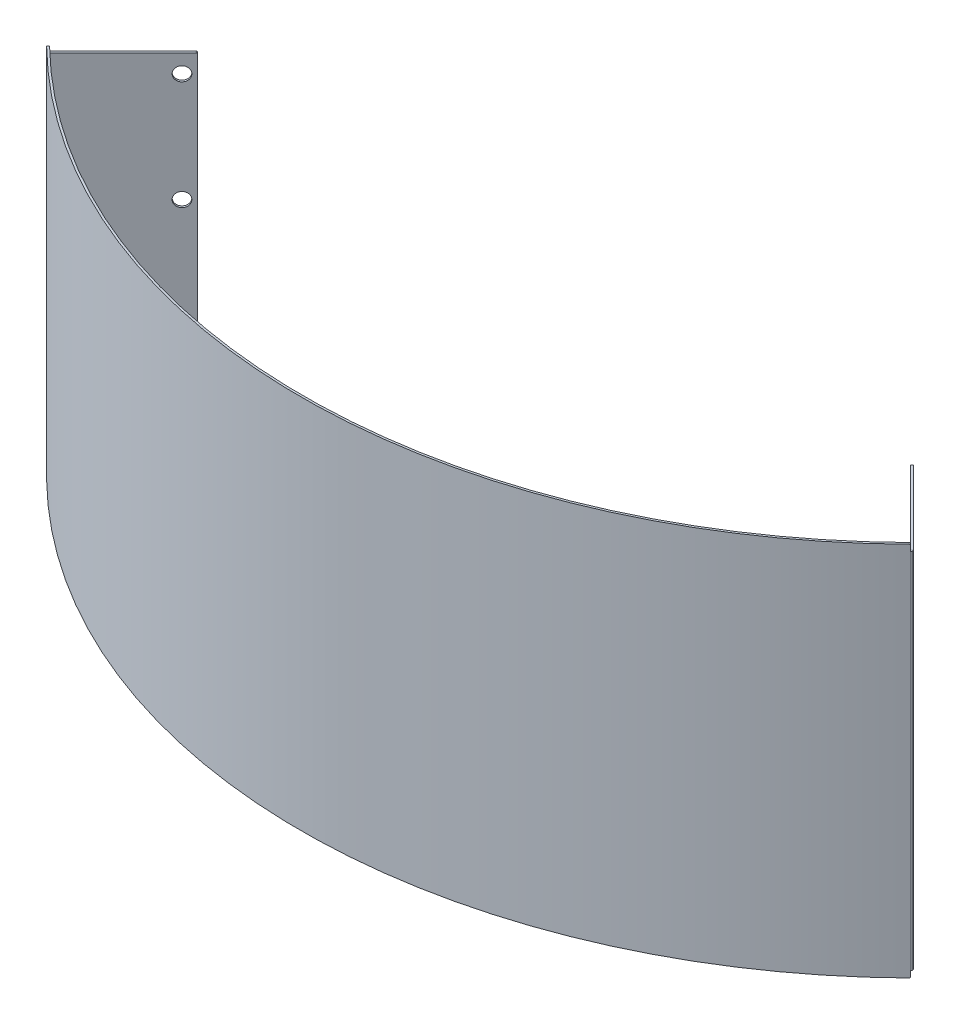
ISO-10303-21;
HEADER;
FILE_DESCRIPTION(('STEP AP214'),'2;1');
FILE_NAME('part.step','',(''),(''),'','','');
FILE_SCHEMA(('AUTOMOTIVE_DESIGN { 1 0 10303 214 1 1 1 1 }'));
ENDSEC;
DATA;
#1=APPLICATION_CONTEXT('core data for automotive mechanical design processes');
#2=APPLICATION_PROTOCOL_DEFINITION('international standard','automotive_design',2000,#1);
#3=PRODUCT_CONTEXT('',#1,'mechanical');
#4=PRODUCT('Part','Part','',(#3));
#5=PRODUCT_RELATED_PRODUCT_CATEGORY('part','',(#4));
#6=PRODUCT_DEFINITION_FORMATION('','',#4);
#7=PRODUCT_DEFINITION_CONTEXT('part definition',#1,'design');
#8=PRODUCT_DEFINITION('design','',#6,#7);
#9=PRODUCT_DEFINITION_SHAPE('','',#8);
#10=(LENGTH_UNIT() NAMED_UNIT(*) SI_UNIT(.MILLI.,.METRE.));
#11=(NAMED_UNIT(*) PLANE_ANGLE_UNIT() SI_UNIT($,.RADIAN.));
#12=(NAMED_UNIT(*) SI_UNIT($,.STERADIAN.) SOLID_ANGLE_UNIT());
#13=UNCERTAINTY_MEASURE_WITH_UNIT(LENGTH_MEASURE(1.E-05),#10,'distance_accuracy_value','');
#14=(GEOMETRIC_REPRESENTATION_CONTEXT(3) GLOBAL_UNCERTAINTY_ASSIGNED_CONTEXT((#13)) GLOBAL_UNIT_ASSIGNED_CONTEXT((#10,
#11,#12)) REPRESENTATION_CONTEXT('',''));
#15=CARTESIAN_POINT('',(0.,0.,0.));
#16=DIRECTION('',(0.,0.,1.));
#17=DIRECTION('',(1.,0.,0.));
#18=AXIS2_PLACEMENT_3D('',#15,#16,#17);
#19=CARTESIAN_POINT('',(392.400458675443,-3.9687500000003,397.843336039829));
#20=DIRECTION('',(0.711960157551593,0.,-0.702219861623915));
#21=DIRECTION('',(0.,1.,0.));
#22=AXIS2_PLACEMENT_3D('',#19,#20,#21);
#23=PLANE('',#22);
#24=DIRECTION('',(0.,1.,0.));
#25=VECTOR('',#24,1.);
#26=CARTESIAN_POINT('',(391.06272983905,-938.147957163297,396.487051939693));
#27=LINE('',#26,#25);
#28=CARTESIAN_POINT('',(391.062729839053,160.9725,396.487051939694));
#29=VERTEX_POINT('',#28);
#30=CARTESIAN_POINT('',(391.06272983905,165.893749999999,396.487051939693));
#31=VERTEX_POINT('',#30);
#32=EDGE_CURVE('E359',#29,#31,#27,.T.);
#33=ORIENTED_EDGE('',*,*,#32,.T.);
#34=DIRECTION('',(0.702219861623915,0.,0.711960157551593));
#35=VECTOR('',#34,1.);
#36=CARTESIAN_POINT('',(392.400458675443,165.89375,397.843336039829));
#37=LINE('',#36,#35);
#38=CARTESIAN_POINT('',(392.400458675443,165.89375,397.843336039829));
#39=VERTEX_POINT('',#38);
#40=EDGE_CURVE('E362',#31,#39,#37,.T.);
#41=ORIENTED_EDGE('',*,*,#40,.T.);
#42=DIRECTION('',(0.,1.,0.));
#43=VECTOR('',#42,1.);
#44=CARTESIAN_POINT('',(392.400458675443,166.6875,397.843336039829));
#45=LINE('',#44,#43);
#46=CARTESIAN_POINT('',(392.400458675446,160.9725,397.84333603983));
#47=VERTEX_POINT('',#46);
#48=EDGE_CURVE('E537',#47,#39,#45,.T.);
#49=ORIENTED_EDGE('',*,*,#48,.F.);
#50=DIRECTION('',(0.702219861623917,0.,0.711960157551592));
#51=VECTOR('',#50,1.);
#52=CARTESIAN_POINT('',(19.3180393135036,160.9725,19.5859944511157));
#53=LINE('',#52,#51);
#54=EDGE_CURVE('E229',#29,#47,#53,.T.);
#55=ORIENTED_EDGE('',*,*,#54,.F.);
#56=EDGE_LOOP('',(#33,#41,#49,#55));
#57=FACE_BOUND('',#56,.T.);
#58=ADVANCED_FACE('F42',(#57),#23,.T.);
#59=CARTESIAN_POINT('',(-392.400458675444,-3.9687500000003,397.84333603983));
#60=DIRECTION('',(-0.711960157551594,0.,-0.702219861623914));
#61=DIRECTION('',(0.,-1.,0.));
#62=AXIS2_PLACEMENT_3D('',#59,#60,#61);
#63=PLANE('',#62);
#64=DIRECTION('',(0.,1.,0.));
#65=VECTOR('',#64,1.);
#66=CARTESIAN_POINT('',(-391.06272983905,-938.147957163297,396.487051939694));
#67=LINE('',#66,#65);
#68=CARTESIAN_POINT('',(-391.06272983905,-168.91,396.487051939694));
#69=VERTEX_POINT('',#68);
#70=CARTESIAN_POINT('',(-391.06272983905,-173.83125,396.487051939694));
#71=VERTEX_POINT('',#70);
#72=EDGE_CURVE('E543',#69,#71,#67,.F.);
#73=ORIENTED_EDGE('',*,*,#72,.T.);
#74=DIRECTION('',(-0.702219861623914,0.,0.711960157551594));
#75=VECTOR('',#74,1.);
#76=CARTESIAN_POINT('',(-392.400458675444,-173.83125,397.84333603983));
#77=LINE('',#76,#75);
#78=CARTESIAN_POINT('',(-392.400458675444,-173.83125,397.84333603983));
#79=VERTEX_POINT('',#78);
#80=EDGE_CURVE('E375',#71,#79,#77,.T.);
#81=ORIENTED_EDGE('',*,*,#80,.T.);
#82=DIRECTION('',(0.,-1.,0.));
#83=VECTOR('',#82,1.);
#84=CARTESIAN_POINT('',(-392.400458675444,166.6875,397.84333603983));
#85=LINE('',#84,#83);
#86=CARTESIAN_POINT('',(-392.400458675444,-168.91,397.84333603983));
#87=VERTEX_POINT('',#86);
#88=EDGE_CURVE('E217',#87,#79,#85,.T.);
#89=ORIENTED_EDGE('',*,*,#88,.F.);
#90=DIRECTION('',(-0.702219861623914,0.,0.711960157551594));
#91=VECTOR('',#90,1.);
#92=CARTESIAN_POINT('',(-19.3180393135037,-168.91,19.5859944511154));
#93=LINE('',#92,#91);
#94=EDGE_CURVE('E246',#69,#87,#93,.T.);
#95=ORIENTED_EDGE('',*,*,#94,.F.);
#96=EDGE_LOOP('',(#73,#81,#89,#95));
#97=FACE_BOUND('',#96,.T.);
#98=ADVANCED_FACE('F604',(#97),#63,.T.);
#99=CARTESIAN_POINT('',(-5.55111512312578E-13,166.6875,-9.24607612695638E-13));
#100=DIRECTION('',(0.,1.,0.));
#101=DIRECTION('',(0.999976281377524,0.,-0.00688742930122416));
#102=AXIS2_PLACEMENT_3D('',#99,#100,#101);
#103=PLANE('',#102);
#104=CARTESIAN_POINT('',(-5.55111512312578E-13,166.6875,-9.24607612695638E-13));
#105=DIRECTION('',(0.,-1.,0.));
#106=DIRECTION('',(-0.999976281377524,0.,0.00688742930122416));
#107=AXIS2_PLACEMENT_3D('',#104,#105,#106);
#108=CIRCLE('',#107,558.8);
#109=CARTESIAN_POINT('',(391.834944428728,166.6875,398.400321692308));
#110=VERTEX_POINT('',#109);
#111=CARTESIAN_POINT('',(-391.834944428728,166.6875,398.400321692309));
#112=VERTEX_POINT('',#111);
#113=EDGE_CURVE('E358',#110,#112,#108,.T.);
#114=ORIENTED_EDGE('',*,*,#113,.F.);
#115=DIRECTION('',(0.702219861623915,0.,0.711960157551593));
#116=VECTOR('',#115,1.);
#117=CARTESIAN_POINT('',(-0.56511837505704,166.6875,0.557387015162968));
#118=LINE('',#117,#116);
#119=CARTESIAN_POINT('',(390.497214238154,166.687499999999,397.044036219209));
#120=VERTEX_POINT('',#119);
#121=EDGE_CURVE('E371',#110,#120,#118,.F.);
#122=ORIENTED_EDGE('',*,*,#121,.T.);
#123=CARTESIAN_POINT('',(-5.55111512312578E-13,166.687499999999,-9.24607612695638E-13));
#124=DIRECTION('',(0.,1.,0.));
#125=DIRECTION('',(0.999976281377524,0.,-0.00688742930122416));
#126=AXIS2_PLACEMENT_3D('',#123,#124,#125);
#127=CIRCLE('',#126,556.895);
#128=CARTESIAN_POINT('',(-390.497214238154,166.687499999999,397.044036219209));
#129=VERTEX_POINT('',#128);
#130=EDGE_CURVE('E530',#120,#129,#127,.F.);
#131=ORIENTED_EDGE('',*,*,#130,.T.);
#132=DIRECTION('',(-0.702219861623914,0.,0.711960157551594));
#133=VECTOR('',#132,1.);
#134=CARTESIAN_POINT('',(0.565118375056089,166.6875,0.557387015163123));
#135=LINE('',#134,#133);
#136=EDGE_CURVE('E364',#129,#112,#135,.T.);
#137=ORIENTED_EDGE('',*,*,#136,.T.);
#138=EDGE_LOOP('',(#114,#122,#131,#137));
#139=FACE_BOUND('',#138,.T.);
#140=ADVANCED_FACE('F609',(#139),#103,.T.);
#141=CARTESIAN_POINT('',(-392.400458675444,165.89375,397.84333603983));
#142=VERTEX_POINT('',#141);
#143=CARTESIAN_POINT('',(-392.400458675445,160.9725,397.843336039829));
#144=VERTEX_POINT('',#143);
#145=EDGE_CURVE('E205',#142,#144,#85,.T.);
#146=ORIENTED_EDGE('',*,*,#145,.F.);
#147=DIRECTION('',(-0.702219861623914,0.,0.711960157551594));
#148=VECTOR('',#147,1.);
#149=CARTESIAN_POINT('',(-392.400458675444,165.89375,397.84333603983));
#150=LINE('',#149,#148);
#151=CARTESIAN_POINT('',(-391.06272983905,165.893749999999,396.487051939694));
#152=VERTEX_POINT('',#151);
#153=EDGE_CURVE('E378',#142,#152,#150,.F.);
#154=ORIENTED_EDGE('',*,*,#153,.T.);
#155=CARTESIAN_POINT('',(-391.06272983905,160.9725,396.487051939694));
#156=VERTEX_POINT('',#155);
#157=EDGE_CURVE('E243',#152,#156,#67,.F.);
#158=ORIENTED_EDGE('',*,*,#157,.T.);
#159=DIRECTION('',(-0.702219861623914,0.,0.711960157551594));
#160=VECTOR('',#159,1.);
#161=CARTESIAN_POINT('',(-19.3180393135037,160.9725,19.5859944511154));
#162=LINE('',#161,#160);
#163=EDGE_CURVE('E228',#156,#144,#162,.T.);
#164=ORIENTED_EDGE('',*,*,#163,.T.);
#165=EDGE_LOOP('',(#146,#154,#158,#164));
#166=FACE_BOUND('',#165,.T.);
#167=ADVANCED_FACE('F241',(#166),#63,.T.);
#168=CARTESIAN_POINT('',(-5.55111512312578E-13,-174.625,-9.24607612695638E-13));
#169=DIRECTION('',(0.,-1.,0.));
#170=DIRECTION('',(-0.999976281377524,0.,0.00688742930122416));
#171=AXIS2_PLACEMENT_3D('',#168,#169,#170);
#172=PLANE('',#171);
#173=CARTESIAN_POINT('',(-5.55111512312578E-13,-174.625,-9.24607612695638E-13));
#174=DIRECTION('',(0.,1.,0.));
#175=DIRECTION('',(0.999976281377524,0.,-0.00688742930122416));
#176=AXIS2_PLACEMENT_3D('',#173,#174,#175);
#177=CIRCLE('',#176,556.895);
#178=CARTESIAN_POINT('',(-390.497214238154,-174.625,397.044036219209));
#179=VERTEX_POINT('',#178);
#180=CARTESIAN_POINT('',(390.497214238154,-174.625,397.044036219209));
#181=VERTEX_POINT('',#180);
#182=EDGE_CURVE('E540',#179,#181,#177,.T.);
#183=ORIENTED_EDGE('',*,*,#182,.T.);
#184=DIRECTION('',(0.702219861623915,0.,0.711960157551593));
#185=VECTOR('',#184,1.);
#186=CARTESIAN_POINT('',(-0.56511837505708,-174.625,0.557387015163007));
#187=LINE('',#186,#185);
#188=CARTESIAN_POINT('',(391.834944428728,-174.625,398.400321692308));
#189=VERTEX_POINT('',#188);
#190=EDGE_CURVE('E253',#181,#189,#187,.T.);
#191=ORIENTED_EDGE('',*,*,#190,.T.);
#192=CARTESIAN_POINT('',(-5.55111512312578E-13,-174.625,-9.24607612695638E-13));
#193=DIRECTION('',(0.,1.,0.));
#194=DIRECTION('',(0.999976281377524,0.,-0.00688742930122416));
#195=AXIS2_PLACEMENT_3D('',#192,#193,#194);
#196=CIRCLE('',#195,558.8);
#197=CARTESIAN_POINT('',(-391.834944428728,-174.625,398.400321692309));
#198=VERTEX_POINT('',#197);
#199=EDGE_CURVE('E216',#198,#189,#196,.T.);
#200=ORIENTED_EDGE('',*,*,#199,.F.);
#201=DIRECTION('',(-0.702219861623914,0.,0.711960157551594));
#202=VECTOR('',#201,1.);
#203=CARTESIAN_POINT('',(0.565118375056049,-174.625,0.557387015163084));
#204=LINE('',#203,#202);
#205=EDGE_CURVE('E251',#198,#179,#204,.F.);
#206=ORIENTED_EDGE('',*,*,#205,.T.);
#207=EDGE_LOOP('',(#183,#191,#200,#206));
#208=FACE_BOUND('',#207,.T.);
#209=ADVANCED_FACE('F306',(#208),#172,.T.);
#210=CARTESIAN_POINT('',(392.400458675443,-173.83125,397.843336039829));
#211=VERTEX_POINT('',#210);
#212=CARTESIAN_POINT('',(392.400458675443,-168.91,397.843336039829));
#213=VERTEX_POINT('',#212);
#214=EDGE_CURVE('E350',#211,#213,#45,.T.);
#215=ORIENTED_EDGE('',*,*,#214,.F.);
#216=DIRECTION('',(0.702219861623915,0.,0.711960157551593));
#217=VECTOR('',#216,1.);
#218=CARTESIAN_POINT('',(392.400458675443,-173.83125,397.843336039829));
#219=LINE('',#218,#217);
#220=CARTESIAN_POINT('',(391.06272983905,-173.83125,396.487051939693));
#221=VERTEX_POINT('',#220);
#222=EDGE_CURVE('E293',#211,#221,#219,.F.);
#223=ORIENTED_EDGE('',*,*,#222,.T.);
#224=CARTESIAN_POINT('',(391.062729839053,-168.91,396.487051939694));
#225=VERTEX_POINT('',#224);
#226=EDGE_CURVE('E348',#221,#225,#27,.T.);
#227=ORIENTED_EDGE('',*,*,#226,.T.);
#228=DIRECTION('',(0.702219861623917,0.,0.711960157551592));
#229=VECTOR('',#228,1.);
#230=CARTESIAN_POINT('',(19.3180393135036,-168.91,19.5859944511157));
#231=LINE('',#230,#229);
#232=EDGE_CURVE('E548',#225,#213,#231,.T.);
#233=ORIENTED_EDGE('',*,*,#232,.T.);
#234=EDGE_LOOP('',(#215,#223,#227,#233));
#235=FACE_BOUND('',#234,.T.);
#236=ADVANCED_FACE('F346',(#235),#23,.T.);
#237=CARTESIAN_POINT('',(-5.55111512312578E-13,-938.147957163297,-9.24607612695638E-13));
#238=DIRECTION('',(0.,1.,0.));
#239=DIRECTION('',(0.999976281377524,0.,-0.00688742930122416));
#240=AXIS2_PLACEMENT_3D('',#237,#238,#239);
#241=CYLINDRICAL_SURFACE('',#240,558.8);
#242=ORIENTED_EDGE('',*,*,#199,.T.);
#243=CARTESIAN_POINT('',(391.834944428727,-174.625,398.400321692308));
#244=CARTESIAN_POINT('',(391.866781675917,-174.62503792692,398.369009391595));
#245=CARTESIAN_POINT('',(391.898606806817,-174.621233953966,398.337700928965));
#246=CARTESIAN_POINT('',(391.961325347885,-174.606222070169,398.275986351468));
#247=CARTESIAN_POINT('',(391.992219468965,-174.595019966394,398.245579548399));
#248=CARTESIAN_POINT('',(392.05223560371,-174.565483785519,398.186496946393));
#249=CARTESIAN_POINT('',(392.081356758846,-174.547146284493,398.157821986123));
#250=CARTESIAN_POINT('',(392.136981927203,-174.503875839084,398.103038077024));
#251=CARTESIAN_POINT('',(392.16348640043,-174.478944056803,398.076928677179));
#252=CARTESIAN_POINT('',(392.21313288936,-174.423188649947,398.028013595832));
#253=CARTESIAN_POINT('',(392.236274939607,-174.392365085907,398.00520788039));
#254=CARTESIAN_POINT('',(392.278546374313,-174.325693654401,397.963544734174));
#255=CARTESIAN_POINT('',(392.297674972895,-174.28984480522,397.944688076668));
#256=CARTESIAN_POINT('',(392.331375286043,-174.214142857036,397.911463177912));
#257=CARTESIAN_POINT('',(392.345946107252,-174.17428897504,397.897095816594));
#258=CARTESIAN_POINT('',(392.370108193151,-174.091719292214,397.873269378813));
#259=CARTESIAN_POINT('',(392.379702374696,-174.049005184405,397.863807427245));
#260=CARTESIAN_POINT('',(392.391255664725,-173.976899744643,397.85241298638));
#261=CARTESIAN_POINT('',(392.394704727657,-173.947962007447,397.849011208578));
#262=CARTESIAN_POINT('',(392.399305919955,-173.889770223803,397.844473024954));
#263=CARTESIAN_POINT('',(392.400461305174,-173.860516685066,397.843333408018));
#264=CARTESIAN_POINT('',(392.400458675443,-173.83125,397.843336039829));
#265=B_SPLINE_CURVE_WITH_KNOTS('',3,(#243,#244,#245,#246,#247,#248,#249,#250,#251,#252,#253,
#254,#255,#256,#257,#258,#259,#260,#261,#262,#263,#264),.UNSPECIFIED.,.F.,.F.,(4,2,2,2,2,2,2,2,
2,2,4),(0.,0.133787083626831,0.267469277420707,0.401215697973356,0.534938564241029,
0.668660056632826,0.802407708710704,0.936181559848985,1.06987691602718,1.15773121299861,
1.24546071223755),.UNSPECIFIED.);
#266=EDGE_CURVE('E337',#189,#211,#265,.T.);
#267=ORIENTED_EDGE('',*,*,#266,.T.);
#268=ORIENTED_EDGE('',*,*,#214,.T.);
#269=DIRECTION('',(0.,-1.,0.));
#270=VECTOR('',#269,1.);
#271=CARTESIAN_POINT('',(392.400458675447,166.6875,397.84333603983));
#272=LINE('',#271,#270);
#273=EDGE_CURVE('E539',#47,#213,#272,.T.);
#274=ORIENTED_EDGE('',*,*,#273,.F.);
#275=ORIENTED_EDGE('',*,*,#48,.T.);
#276=CARTESIAN_POINT('',(392.400458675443,165.89375,397.843336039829));
#277=CARTESIAN_POINT('',(392.400485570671,165.938405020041,397.8433092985));
#278=CARTESIAN_POINT('',(392.397777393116,165.983048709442,397.845980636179));
#279=CARTESIAN_POINT('',(392.387089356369,166.071039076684,397.856522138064));
#280=CARTESIAN_POINT('',(392.379113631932,166.114386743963,397.864388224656));
#281=CARTESIAN_POINT('',(392.35808334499,166.198604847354,397.885127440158));
#282=CARTESIAN_POINT('',(392.345026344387,166.239474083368,397.8980029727));
#283=CARTESIAN_POINT('',(392.314214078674,166.317547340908,397.928382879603));
#284=CARTESIAN_POINT('',(392.296459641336,166.354752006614,397.945886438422));
#285=CARTESIAN_POINT('',(392.256751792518,166.424447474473,397.985026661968));
#286=CARTESIAN_POINT('',(392.234798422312,166.456938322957,398.006663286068));
#287=CARTESIAN_POINT('',(392.187308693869,166.516290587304,398.05345873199));
#288=CARTESIAN_POINT('',(392.161771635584,166.543150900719,398.078618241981));
#289=CARTESIAN_POINT('',(392.107839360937,166.590475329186,398.131741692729));
#290=CARTESIAN_POINT('',(392.079443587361,166.610938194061,398.159706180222));
#291=CARTESIAN_POINT('',(392.020606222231,166.644871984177,398.217636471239));
#292=CARTESIAN_POINT('',(391.990165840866,166.658347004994,398.247601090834));
#293=CARTESIAN_POINT('',(391.938773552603,166.674573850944,398.298178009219));
#294=CARTESIAN_POINT('',(391.918146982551,166.679418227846,398.318474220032));
#295=CARTESIAN_POINT('',(391.876665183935,166.68588087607,398.359285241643));
#296=CARTESIAN_POINT('',(391.855810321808,166.687503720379,398.37979970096));
#297=CARTESIAN_POINT('',(391.834944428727,166.6875,398.400321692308));
#298=B_SPLINE_CURVE_WITH_KNOTS('',3,(#276,#277,#278,#279,#280,#281,#282,#283,#284,#285,#286,
#287,#288,#289,#290,#291,#292,#293,#294,#295,#296,#297),.UNSPECIFIED.,.F.,.F.,(4,2,2,2,2,2,2,2,
2,2,4),(0.,0.133787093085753,0.267469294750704,0.401215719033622,0.534938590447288,
0.668660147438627,0.802407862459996,0.936181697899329,1.06987703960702,1.15773127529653,
1.24546071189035),.UNSPECIFIED.);
#299=EDGE_CURVE('E332',#39,#110,#298,.T.);
#300=ORIENTED_EDGE('',*,*,#299,.T.);
#301=ORIENTED_EDGE('',*,*,#113,.T.);
#302=CARTESIAN_POINT('',(-391.834944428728,166.6875,398.400321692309));
#303=CARTESIAN_POINT('',(-391.866781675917,166.68753792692,398.369009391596));
#304=CARTESIAN_POINT('',(-391.898606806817,166.683733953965,398.337700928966));
#305=CARTESIAN_POINT('',(-391.961325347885,166.668722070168,398.275986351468));
#306=CARTESIAN_POINT('',(-391.992219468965,166.657519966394,398.2455795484));
#307=CARTESIAN_POINT('',(-392.05223560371,166.627983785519,398.186496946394));
#308=CARTESIAN_POINT('',(-392.081356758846,166.609646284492,398.157821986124));
#309=CARTESIAN_POINT('',(-392.136981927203,166.566375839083,398.103038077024));
#310=CARTESIAN_POINT('',(-392.16348640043,166.541444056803,398.07692867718));
#311=CARTESIAN_POINT('',(-392.213132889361,166.485688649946,398.028013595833));
#312=CARTESIAN_POINT('',(-392.236274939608,166.454865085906,398.005207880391));
#313=CARTESIAN_POINT('',(-392.278546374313,166.388193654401,397.963544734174));
#314=CARTESIAN_POINT('',(-392.297674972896,166.35234480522,397.944688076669));
#315=CARTESIAN_POINT('',(-392.331375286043,166.276642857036,397.911463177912));
#316=CARTESIAN_POINT('',(-392.345946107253,166.23678897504,397.897095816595));
#317=CARTESIAN_POINT('',(-392.370108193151,166.154219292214,397.873269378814));
#318=CARTESIAN_POINT('',(-392.379702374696,166.111505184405,397.863807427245));
#319=CARTESIAN_POINT('',(-392.391255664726,166.039399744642,397.852412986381));
#320=CARTESIAN_POINT('',(-392.394704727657,166.010462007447,397.849011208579));
#321=CARTESIAN_POINT('',(-392.399305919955,165.952270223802,397.844473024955));
#322=CARTESIAN_POINT('',(-392.400461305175,165.923016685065,397.843333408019));
#323=CARTESIAN_POINT('',(-392.400458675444,165.89375,397.84333603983));
#324=B_SPLINE_CURVE_WITH_KNOTS('',3,(#302,#303,#304,#305,#306,#307,#308,#309,#310,#311,#312,
#313,#314,#315,#316,#317,#318,#319,#320,#321,#322,#323),.UNSPECIFIED.,.F.,.F.,(4,2,2,2,2,2,2,2,
2,2,4),(0.,0.133787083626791,0.26746927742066,0.401215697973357,0.534938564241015,
0.668660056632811,0.802407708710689,0.936181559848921,1.06987691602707,1.15773121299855,
1.24546071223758),.UNSPECIFIED.);
#325=EDGE_CURVE('E212',#112,#142,#324,.T.);
#326=ORIENTED_EDGE('',*,*,#325,.T.);
#327=ORIENTED_EDGE('',*,*,#145,.T.);
#328=DIRECTION('',(0.,-1.,0.));
#329=VECTOR('',#328,1.);
#330=CARTESIAN_POINT('',(-392.400458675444,166.6875,397.84333603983));
#331=LINE('',#330,#329);
#332=EDGE_CURVE('E210',#144,#87,#331,.T.);
#333=ORIENTED_EDGE('',*,*,#332,.T.);
#334=ORIENTED_EDGE('',*,*,#88,.T.);
#335=CARTESIAN_POINT('',(-392.400458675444,-173.83125,397.84333603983));
#336=CARTESIAN_POINT('',(-392.400485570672,-173.875905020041,397.8433092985));
#337=CARTESIAN_POINT('',(-392.397777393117,-173.920548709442,397.84598063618));
#338=CARTESIAN_POINT('',(-392.38708935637,-174.008539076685,397.856522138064));
#339=CARTESIAN_POINT('',(-392.379113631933,-174.051886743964,397.864388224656));
#340=CARTESIAN_POINT('',(-392.35808334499,-174.136104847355,397.885127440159));
#341=CARTESIAN_POINT('',(-392.345026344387,-174.176974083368,397.8980029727));
#342=CARTESIAN_POINT('',(-392.314214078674,-174.255047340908,397.928382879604));
#343=CARTESIAN_POINT('',(-392.296459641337,-174.292252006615,397.945886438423));
#344=CARTESIAN_POINT('',(-392.256751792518,-174.361947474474,397.985026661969));
#345=CARTESIAN_POINT('',(-392.234798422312,-174.394438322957,398.006663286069));
#346=CARTESIAN_POINT('',(-392.18730869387,-174.453790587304,398.05345873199));
#347=CARTESIAN_POINT('',(-392.161771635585,-174.480650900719,398.078618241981));
#348=CARTESIAN_POINT('',(-392.107839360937,-174.527975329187,398.13174169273));
#349=CARTESIAN_POINT('',(-392.079443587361,-174.548438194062,398.159706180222));
#350=CARTESIAN_POINT('',(-392.020606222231,-174.582371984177,398.217636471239));
#351=CARTESIAN_POINT('',(-391.990165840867,-174.595847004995,398.247601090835));
#352=CARTESIAN_POINT('',(-391.938773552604,-174.612073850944,398.29817800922));
#353=CARTESIAN_POINT('',(-391.918146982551,-174.616918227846,398.318474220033));
#354=CARTESIAN_POINT('',(-391.876665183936,-174.623380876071,398.359285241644));
#355=CARTESIAN_POINT('',(-391.855810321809,-174.62500372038,398.37979970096));
#356=CARTESIAN_POINT('',(-391.834944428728,-174.625,398.400321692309));
#357=B_SPLINE_CURVE_WITH_KNOTS('',3,(#335,#336,#337,#338,#339,#340,#341,#342,#343,#344,#345,
#346,#347,#348,#349,#350,#351,#352,#353,#354,#355,#356),.UNSPECIFIED.,.F.,.F.,(4,2,2,2,2,2,2,2,
2,2,4),(0.,0.133787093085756,0.267469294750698,0.401215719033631,0.534938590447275,
0.668660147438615,0.802407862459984,0.936181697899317,1.06987703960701,1.15773127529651,
1.24546071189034),.UNSPECIFIED.);
#358=EDGE_CURVE('E263',#79,#198,#357,.T.);
#359=ORIENTED_EDGE('',*,*,#358,.T.);
#360=EDGE_LOOP('',(#242,#267,#268,#274,#275,#300,#301,#326,#327,#333,#334,#359));
#361=FACE_BOUND('',#360,.T.);
#362=ADVANCED_FACE('F208',(#361),#241,.T.);
#363=CARTESIAN_POINT('',(-5.55111512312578E-13,-938.147957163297,-9.24607612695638E-13));
#364=DIRECTION('',(0.,1.,0.));
#365=DIRECTION('',(0.999976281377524,0.,-0.00688742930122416));
#366=AXIS2_PLACEMENT_3D('',#363,#364,#365);
#367=CYLINDRICAL_SURFACE('',#366,556.895);
#368=ORIENTED_EDGE('',*,*,#226,.F.);
#369=CARTESIAN_POINT('',(391.06272983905,-173.83125,396.487051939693));
#370=CARTESIAN_POINT('',(391.062756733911,-173.875905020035,396.487025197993));
#371=CARTESIAN_POINT('',(391.060048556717,-173.92054870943,396.489696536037));
#372=CARTESIAN_POINT('',(391.049360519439,-174.008539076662,396.500238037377));
#373=CARTESIAN_POINT('',(391.041384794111,-174.051886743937,396.508104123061));
#374=CARTESIAN_POINT('',(391.020354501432,-174.136104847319,396.528843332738));
#375=CARTESIAN_POINT('',(391.007297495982,-174.17697408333,396.54171886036));
#376=CARTESIAN_POINT('',(390.976485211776,-174.255047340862,396.572098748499));
#377=CARTESIAN_POINT('',(390.958730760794,-174.292252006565,396.589602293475));
#378=CARTESIAN_POINT('',(390.919022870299,-174.361947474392,396.628742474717));
#379=CARTESIAN_POINT('',(390.897069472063,-174.394438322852,396.650379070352));
#380=CARTESIAN_POINT('',(390.849579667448,-174.453790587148,396.697174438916));
#381=CARTESIAN_POINT('',(390.824042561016,-174.480650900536,396.722333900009));
#382=CARTESIAN_POINT('',(390.770110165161,-174.527975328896,396.775457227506));
#383=CARTESIAN_POINT('',(390.741714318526,-174.548438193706,396.803421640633));
#384=CARTESIAN_POINT('',(390.682876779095,-174.582371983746,396.861351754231));
#385=CARTESIAN_POINT('',(390.652436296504,-174.595847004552,396.891316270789));
#386=CARTESIAN_POINT('',(390.601043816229,-174.612073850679,396.941892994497));
#387=CARTESIAN_POINT('',(390.580417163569,-174.616918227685,396.962189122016));
#388=CARTESIAN_POINT('',(390.538935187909,-174.623380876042,397.002999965));
#389=CARTESIAN_POINT('',(390.518080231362,-174.62500372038,397.023514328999));
#390=CARTESIAN_POINT('',(390.497214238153,-174.625,397.044036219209));
#391=B_SPLINE_CURVE_WITH_KNOTS('',3,(#369,#370,#371,#372,#373,#374,#375,#376,#377,#378,#379,
#380,#381,#382,#383,#384,#385,#386,#387,#388,#389,#390),.UNSPECIFIED.,.F.,.F.,(4,2,2,2,2,2,2,2,
2,2,4),(0.,0.133787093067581,0.267469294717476,0.401215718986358,0.534938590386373,
0.668660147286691,0.802407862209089,0.936181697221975,1.06987703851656,1.15773127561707,
1.24546071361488),.UNSPECIFIED.);
#392=EDGE_CURVE('E317',#221,#181,#391,.T.);
#393=ORIENTED_EDGE('',*,*,#392,.T.);
#394=ORIENTED_EDGE('',*,*,#182,.F.);
#395=CARTESIAN_POINT('',(-390.497214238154,-174.625,397.044036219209));
#396=CARTESIAN_POINT('',(-390.529051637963,-174.625037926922,397.01272407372));
#397=CARTESIAN_POINT('',(-390.560876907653,-174.621233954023,396.981415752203));
#398=CARTESIAN_POINT('',(-390.623595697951,-174.606222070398,396.919701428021));
#399=CARTESIAN_POINT('',(-390.654489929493,-174.59501996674,396.889294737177));
#400=CARTESIAN_POINT('',(-390.714506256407,-174.565483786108,396.83021233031));
#401=CARTESIAN_POINT('',(-390.743627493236,-174.547146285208,396.801537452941));
#402=CARTESIAN_POINT('',(-390.799252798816,-174.503875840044,396.746753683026));
#403=CARTESIAN_POINT('',(-390.825757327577,-174.478944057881,396.720644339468));
#404=CARTESIAN_POINT('',(-390.875403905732,-174.423188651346,396.671729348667));
#405=CARTESIAN_POINT('',(-390.898545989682,-174.392365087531,396.648923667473));
#406=CARTESIAN_POINT('',(-390.940817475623,-174.32569365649,396.607260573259));
#407=CARTESIAN_POINT('',(-390.959946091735,-174.289844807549,396.588403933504));
#408=CARTESIAN_POINT('',(-390.993646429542,-174.21414285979,396.555179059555));
#409=CARTESIAN_POINT('',(-391.008217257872,-174.174288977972,396.540811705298));
#410=CARTESIAN_POINT('',(-391.032379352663,-174.091719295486,396.516985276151));
#411=CARTESIAN_POINT('',(-391.041973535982,-174.049005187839,396.507523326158));
#412=CARTESIAN_POINT('',(-391.053526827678,-173.976899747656,396.496128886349));
#413=CARTESIAN_POINT('',(-391.056975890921,-173.947962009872,396.492727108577));
#414=CARTESIAN_POINT('',(-391.061577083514,-173.889770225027,396.488188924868));
#415=CARTESIAN_POINT('',(-391.062732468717,-173.860516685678,396.487049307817));
#416=CARTESIAN_POINT('',(-391.06272983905,-173.83125,396.487051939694));
#417=B_SPLINE_CURVE_WITH_KNOTS('',3,(#395,#396,#397,#398,#399,#400,#401,#402,#403,#404,#405,
#406,#407,#408,#409,#410,#411,#412,#413,#414,#415,#416),.UNSPECIFIED.,.F.,.F.,(4,2,2,2,2,2,2,2,
2,2,4),(0.,0.133787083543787,0.26746927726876,0.401215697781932,0.534938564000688,
0.668660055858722,0.802407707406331,0.936181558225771,1.06987691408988,1.15773121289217,
1.24546071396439),.UNSPECIFIED.);
#418=EDGE_CURVE('E292',#179,#71,#417,.T.);
#419=ORIENTED_EDGE('',*,*,#418,.T.);
#420=ORIENTED_EDGE('',*,*,#72,.F.);
#421=DIRECTION('',(0.,-1.,0.));
#422=VECTOR('',#421,1.);
#423=CARTESIAN_POINT('',(-391.06272983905,166.6875,396.487051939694));
#424=LINE('',#423,#422);
#425=EDGE_CURVE('E244',#156,#69,#424,.T.);
#426=ORIENTED_EDGE('',*,*,#425,.F.);
#427=ORIENTED_EDGE('',*,*,#157,.F.);
#428=CARTESIAN_POINT('',(-391.06272983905,165.89375,396.487051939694));
#429=CARTESIAN_POINT('',(-391.062756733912,165.938405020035,396.487025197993));
#430=CARTESIAN_POINT('',(-391.060048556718,165.98304870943,396.489696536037));
#431=CARTESIAN_POINT('',(-391.049360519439,166.071039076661,396.500238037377));
#432=CARTESIAN_POINT('',(-391.041384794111,166.114386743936,396.508104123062));
#433=CARTESIAN_POINT('',(-391.020354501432,166.198604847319,396.528843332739));
#434=CARTESIAN_POINT('',(-391.007297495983,166.239474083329,396.541718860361));
#435=CARTESIAN_POINT('',(-390.976485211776,166.317547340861,396.5720987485));
#436=CARTESIAN_POINT('',(-390.958730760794,166.354752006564,396.589602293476));
#437=CARTESIAN_POINT('',(-390.919022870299,166.424447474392,396.628742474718));
#438=CARTESIAN_POINT('',(-390.897069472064,166.456938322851,396.650379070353));
#439=CARTESIAN_POINT('',(-390.849579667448,166.516290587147,396.697174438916));
#440=CARTESIAN_POINT('',(-390.824042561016,166.543150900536,396.72233390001));
#441=CARTESIAN_POINT('',(-390.770110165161,166.590475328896,396.775457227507));
#442=CARTESIAN_POINT('',(-390.741714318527,166.610938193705,396.803421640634));
#443=CARTESIAN_POINT('',(-390.682876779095,166.644871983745,396.861351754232));
#444=CARTESIAN_POINT('',(-390.652436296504,166.658347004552,396.89131627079));
#445=CARTESIAN_POINT('',(-390.60104381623,166.674573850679,396.941892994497));
#446=CARTESIAN_POINT('',(-390.58041716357,166.679418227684,396.962189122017));
#447=CARTESIAN_POINT('',(-390.538935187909,166.685880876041,397.002999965));
#448=CARTESIAN_POINT('',(-390.518080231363,166.68750372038,397.023514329));
#449=CARTESIAN_POINT('',(-390.497214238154,166.6875,397.044036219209));
#450=B_SPLINE_CURVE_WITH_KNOTS('',3,(#428,#429,#430,#431,#432,#433,#434,#435,#436,#437,#438,
#439,#440,#441,#442,#443,#444,#445,#446,#447,#448,#449),.UNSPECIFIED.,.F.,.F.,(4,2,2,2,2,2,2,2,
2,2,4),(0.,0.133787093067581,0.267469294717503,0.401215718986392,0.534938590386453,
0.668660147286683,0.80240786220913,0.936181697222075,1.06987703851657,1.157731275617,
1.24546071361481),.UNSPECIFIED.);
#451=EDGE_CURVE('E285',#152,#129,#450,.T.);
#452=ORIENTED_EDGE('',*,*,#451,.T.);
#453=ORIENTED_EDGE('',*,*,#130,.F.);
#454=CARTESIAN_POINT('',(390.497214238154,166.6875,397.044036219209));
#455=CARTESIAN_POINT('',(390.529051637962,166.687537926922,397.01272407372));
#456=CARTESIAN_POINT('',(390.560876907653,166.683733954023,396.981415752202));
#457=CARTESIAN_POINT('',(390.623595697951,166.668722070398,396.91970142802));
#458=CARTESIAN_POINT('',(390.654489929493,166.657519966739,396.889294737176));
#459=CARTESIAN_POINT('',(390.714506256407,166.627983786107,396.830212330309));
#460=CARTESIAN_POINT('',(390.743627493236,166.609646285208,396.801537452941));
#461=CARTESIAN_POINT('',(390.799252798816,166.566375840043,396.746753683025));
#462=CARTESIAN_POINT('',(390.825757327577,166.541444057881,396.720644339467));
#463=CARTESIAN_POINT('',(390.875403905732,166.485688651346,396.671729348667));
#464=CARTESIAN_POINT('',(390.898545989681,166.45486508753,396.648923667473));
#465=CARTESIAN_POINT('',(390.940817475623,166.388193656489,396.607260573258));
#466=CARTESIAN_POINT('',(390.959946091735,166.352344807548,396.588403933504));
#467=CARTESIAN_POINT('',(390.993646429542,166.276642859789,396.555179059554));
#468=CARTESIAN_POINT('',(391.008217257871,166.236788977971,396.540811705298));
#469=CARTESIAN_POINT('',(391.032379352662,166.154219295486,396.51698527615));
#470=CARTESIAN_POINT('',(391.041973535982,166.111505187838,396.507523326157));
#471=CARTESIAN_POINT('',(391.053526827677,166.039399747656,396.496128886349));
#472=CARTESIAN_POINT('',(391.056975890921,166.010462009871,396.492727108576));
#473=CARTESIAN_POINT('',(391.061577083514,165.952270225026,396.488188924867));
#474=CARTESIAN_POINT('',(391.062732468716,165.923016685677,396.487049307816));
#475=CARTESIAN_POINT('',(391.06272983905,165.89375,396.487051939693));
#476=B_SPLINE_CURVE_WITH_KNOTS('',3,(#454,#455,#456,#457,#458,#459,#460,#461,#462,#463,#464,
#465,#466,#467,#468,#469,#470,#471,#472,#473,#474,#475),.UNSPECIFIED.,.F.,.F.,(4,2,2,2,2,2,2,2,
2,2,4),(0.,0.133787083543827,0.267469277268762,0.401215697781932,0.53493856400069,
0.668660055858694,0.802407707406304,0.936181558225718,1.06987691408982,1.15773121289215,
1.24546071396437),.UNSPECIFIED.);
#477=EDGE_CURVE('E312',#120,#31,#476,.T.);
#478=ORIENTED_EDGE('',*,*,#477,.T.);
#479=ORIENTED_EDGE('',*,*,#32,.F.);
#480=DIRECTION('',(0.,-1.,0.));
#481=VECTOR('',#480,1.);
#482=CARTESIAN_POINT('',(391.062729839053,166.6875,396.487051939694));
#483=LINE('',#482,#481);
#484=EDGE_CURVE('E356',#29,#225,#483,.T.);
#485=ORIENTED_EDGE('',*,*,#484,.T.);
#486=EDGE_LOOP('',(#368,#393,#394,#419,#420,#426,#427,#452,#453,#478,#479,#485));
#487=FACE_BOUND('',#486,.T.);
#488=ADVANCED_FACE('F300',(#487),#367,.F.);
#489=CARTESIAN_POINT('',(391.044893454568,160.9725,396.468968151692));
#490=DIRECTION('',(0.,1.,0.));
#491=DIRECTION('',(0.999976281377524,0.,-0.00688742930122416));
#492=AXIS2_PLACEMENT_3D('',#489,#490,#491);
#493=PLANE('',#492);
#494=DIRECTION('',(-0.707106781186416,0.,0.707106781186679));
#495=VECTOR('',#494,1.);
#496=CARTESIAN_POINT('',(392.40989238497,160.9725,395.103969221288));
#497=LINE('',#496,#495);
#498=CARTESIAN_POINT('',(392.40989238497,160.9725,395.103969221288));
#499=VERTEX_POINT('',#498);
#500=CARTESIAN_POINT('',(391.062853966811,160.9725,396.451007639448));
#501=VERTEX_POINT('',#500);
#502=EDGE_CURVE('E436',#499,#501,#497,.T.);
#503=ORIENTED_EDGE('',*,*,#502,.T.);
#504=CARTESIAN_POINT('',(391.044893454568,160.9725,396.468968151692));
#505=DIRECTION('',(0.,1.,0.));
#506=DIRECTION('',(0.999976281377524,0.,-0.00688742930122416));
#507=AXIS2_PLACEMENT_3D('',#504,#505,#506);
#508=CIRCLE('',#507,0.0254000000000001);
#509=EDGE_CURVE('E474',#501,#29,#508,.F.);
#510=ORIENTED_EDGE('',*,*,#509,.T.);
#511=ORIENTED_EDGE('',*,*,#54,.T.);
#512=CARTESIAN_POINT('',(391.044893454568,160.9725,396.468968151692));
#513=DIRECTION('',(0.,-1.,0.));
#514=DIRECTION('',(0.999976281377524,0.,-0.00688742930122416));
#515=AXIS2_PLACEMENT_3D('',#512,#513,#514);
#516=CIRCLE('',#515,1.93040000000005);
#517=EDGE_CURVE('E523',#499,#47,#516,.T.);
#518=ORIENTED_EDGE('',*,*,#517,.F.);
#519=EDGE_LOOP('',(#503,#510,#511,#518));
#520=FACE_BOUND('',#519,.T.);
#521=ADVANCED_FACE('F304',(#520),#493,.T.);
#522=CARTESIAN_POINT('',(391.044893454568,-168.91,396.468968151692));
#523=DIRECTION('',(0.,-1.,0.));
#524=DIRECTION('',(-0.999976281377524,0.,0.00688742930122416));
#525=AXIS2_PLACEMENT_3D('',#522,#523,#524);
#526=PLANE('',#525);
#527=ORIENTED_EDGE('',*,*,#232,.F.);
#528=CARTESIAN_POINT('',(391.044893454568,-168.91,396.468968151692));
#529=DIRECTION('',(0.,1.,0.));
#530=DIRECTION('',(0.999976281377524,0.,-0.00688742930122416));
#531=AXIS2_PLACEMENT_3D('',#528,#529,#530);
#532=CIRCLE('',#531,0.0254000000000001);
#533=CARTESIAN_POINT('',(391.062853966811,-168.91,396.451007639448));
#534=VERTEX_POINT('',#533);
#535=EDGE_CURVE('E527',#225,#534,#532,.T.);
#536=ORIENTED_EDGE('',*,*,#535,.T.);
#537=DIRECTION('',(0.707106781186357,0.,-0.707106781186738));
#538=VECTOR('',#537,1.);
#539=CARTESIAN_POINT('',(391.062853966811,-168.91,396.451007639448));
#540=LINE('',#539,#538);
#541=CARTESIAN_POINT('',(392.409892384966,-168.91,395.103969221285));
#542=VERTEX_POINT('',#541);
#543=EDGE_CURVE('E515',#534,#542,#540,.T.);
#544=ORIENTED_EDGE('',*,*,#543,.T.);
#545=CARTESIAN_POINT('',(391.044893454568,-168.91,396.468968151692));
#546=DIRECTION('',(0.,1.,0.));
#547=DIRECTION('',(-0.999976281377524,0.,0.00688742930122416));
#548=AXIS2_PLACEMENT_3D('',#545,#546,#547);
#549=CIRCLE('',#548,1.93040000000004);
#550=EDGE_CURVE('E526',#213,#542,#549,.T.);
#551=ORIENTED_EDGE('',*,*,#550,.F.);
#552=EDGE_LOOP('',(#527,#536,#544,#551));
#553=FACE_BOUND('',#552,.T.);
#554=ADVANCED_FACE('F566',(#553),#526,.T.);
#555=CARTESIAN_POINT('',(391.044893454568,-333.861074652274,396.468968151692));
#556=DIRECTION('',(0.,1.,0.));
#557=DIRECTION('',(0.999976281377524,0.,-0.00688742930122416));
#558=AXIS2_PLACEMENT_3D('',#555,#556,#557);
#559=CYLINDRICAL_SURFACE('',#558,1.9304);
#560=ORIENTED_EDGE('',*,*,#550,.T.);
#561=DIRECTION('',(0.,-1.,0.));
#562=VECTOR('',#561,1.);
#563=CARTESIAN_POINT('',(392.409892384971,166.6875,395.103969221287));
#564=LINE('',#563,#562);
#565=EDGE_CURVE('E497',#499,#542,#564,.T.);
#566=ORIENTED_EDGE('',*,*,#565,.F.);
#567=ORIENTED_EDGE('',*,*,#517,.T.);
#568=ORIENTED_EDGE('',*,*,#273,.T.);
#569=EDGE_LOOP('',(#560,#566,#567,#568));
#570=FACE_BOUND('',#569,.T.);
#571=ADVANCED_FACE('F557',(#570),#559,.T.);
#572=CARTESIAN_POINT('',(391.044893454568,-333.861074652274,396.468968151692));
#573=DIRECTION('',(0.,1.,0.));
#574=DIRECTION('',(0.999976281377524,0.,-0.00688742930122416));
#575=AXIS2_PLACEMENT_3D('',#572,#573,#574);
#576=CYLINDRICAL_SURFACE('',#575,0.0254000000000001);
#577=ORIENTED_EDGE('',*,*,#535,.F.);
#578=ORIENTED_EDGE('',*,*,#484,.F.);
#579=ORIENTED_EDGE('',*,*,#509,.F.);
#580=DIRECTION('',(0.,-1.,0.));
#581=VECTOR('',#580,1.);
#582=CARTESIAN_POINT('',(391.062853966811,166.6875,396.451007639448));
#583=LINE('',#582,#581);
#584=EDGE_CURVE('E518',#501,#534,#583,.T.);
#585=ORIENTED_EDGE('',*,*,#584,.T.);
#586=EDGE_LOOP('',(#577,#578,#579,#585));
#587=FACE_BOUND('',#586,.T.);
#588=ADVANCED_FACE('F589',(#587),#576,.F.);
#589=CARTESIAN_POINT('',(330.922438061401,144.399,336.310591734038));
#590=DIRECTION('',(0.707106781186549,0.,-0.707106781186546));
#591=DIRECTION('',(-0.707106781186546,0.,-0.707106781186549));
#592=AXIS2_PLACEMENT_3D('',#589,#590,#591);
#593=CYLINDRICAL_SURFACE('',#592,6.35000000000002);
#594=CARTESIAN_POINT('',(330.922438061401,144.399,336.310591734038));
#595=DIRECTION('',(0.707106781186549,0.,-0.707106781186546));
#596=DIRECTION('',(-0.707106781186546,0.,-0.707106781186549));
#597=AXIS2_PLACEMENT_3D('',#594,#595,#596);
#598=CIRCLE('',#597,6.35000000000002);
#599=CARTESIAN_POINT('',(326.432310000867,144.399,331.820463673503));
#600=VERTEX_POINT('',#599);
#601=EDGE_CURVE('E483',#600,#600,#598,.T.);
#602=ORIENTED_EDGE('',*,*,#601,.F.);
#603=EDGE_LOOP('',(#602));
#604=FACE_BOUND('',#603,.T.);
#605=CARTESIAN_POINT('',(332.269476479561,144.399,334.963553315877));
#606=DIRECTION('',(0.707106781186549,0.,-0.707106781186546));
#607=DIRECTION('',(-0.707106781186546,0.,-0.707106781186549));
#608=AXIS2_PLACEMENT_3D('',#605,#606,#607);
#609=CIRCLE('',#608,6.35000000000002);
#610=CARTESIAN_POINT('',(327.779348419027,144.399,330.473425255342));
#611=VERTEX_POINT('',#610);
#612=EDGE_CURVE('E512',#611,#611,#609,.T.);
#613=ORIENTED_EDGE('',*,*,#612,.T.);
#614=EDGE_LOOP('',(#613));
#615=FACE_BOUND('',#614,.T.);
#616=ADVANCED_FACE('F854',(#604,#615),#593,.F.);
#617=CARTESIAN_POINT('',(330.922438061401,-53.4246666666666,336.310591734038));
#618=DIRECTION('',(0.707106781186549,0.,-0.707106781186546));
#619=DIRECTION('',(-0.707106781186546,0.,-0.707106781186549));
#620=AXIS2_PLACEMENT_3D('',#617,#618,#619);
#621=CYLINDRICAL_SURFACE('',#620,6.35000000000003);
#622=CARTESIAN_POINT('',(330.922438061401,-53.4246666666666,336.310591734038));
#623=DIRECTION('',(0.707106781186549,0.,-0.707106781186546));
#624=DIRECTION('',(-0.707106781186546,0.,-0.707106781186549));
#625=AXIS2_PLACEMENT_3D('',#622,#623,#624);
#626=CIRCLE('',#625,6.35000000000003);
#627=CARTESIAN_POINT('',(326.432310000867,-53.4246666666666,331.820463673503));
#628=VERTEX_POINT('',#627);
#629=EDGE_CURVE('E486',#628,#628,#626,.T.);
#630=ORIENTED_EDGE('',*,*,#629,.F.);
#631=EDGE_LOOP('',(#630));
#632=FACE_BOUND('',#631,.T.);
#633=CARTESIAN_POINT('',(332.269476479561,-53.4246666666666,334.963553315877));
#634=DIRECTION('',(0.707106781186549,0.,-0.707106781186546));
#635=DIRECTION('',(-0.707106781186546,0.,-0.707106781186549));
#636=AXIS2_PLACEMENT_3D('',#633,#634,#635);
#637=CIRCLE('',#636,6.35000000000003);
#638=CARTESIAN_POINT('',(327.779348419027,-53.4246666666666,330.473425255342));
#639=VERTEX_POINT('',#638);
#640=EDGE_CURVE('E509',#639,#639,#637,.T.);
#641=ORIENTED_EDGE('',*,*,#640,.T.);
#642=EDGE_LOOP('',(#641));
#643=FACE_BOUND('',#642,.T.);
#644=ADVANCED_FACE('F845',(#632,#643),#621,.F.);
#645=CARTESIAN_POINT('',(330.922438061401,45.4871666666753,336.310591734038));
#646=DIRECTION('',(0.707106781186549,0.,-0.707106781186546));
#647=DIRECTION('',(-0.707106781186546,0.,-0.707106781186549));
#648=AXIS2_PLACEMENT_3D('',#645,#646,#647);
#649=CYLINDRICAL_SURFACE('',#648,6.34999999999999);
#650=CARTESIAN_POINT('',(330.922438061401,45.4871666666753,336.310591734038));
#651=DIRECTION('',(0.707106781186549,0.,-0.707106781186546));
#652=DIRECTION('',(-0.707106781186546,0.,-0.707106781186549));
#653=AXIS2_PLACEMENT_3D('',#650,#651,#652);
#654=CIRCLE('',#653,6.34999999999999);
#655=CARTESIAN_POINT('',(326.432310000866,45.4871666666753,331.820463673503));
#656=VERTEX_POINT('',#655);
#657=EDGE_CURVE('E489',#656,#656,#654,.T.);
#658=ORIENTED_EDGE('',*,*,#657,.F.);
#659=EDGE_LOOP('',(#658));
#660=FACE_BOUND('',#659,.T.);
#661=CARTESIAN_POINT('',(332.269476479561,45.4871666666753,334.963553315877));
#662=DIRECTION('',(0.707106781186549,0.,-0.707106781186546));
#663=DIRECTION('',(-0.707106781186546,0.,-0.707106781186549));
#664=AXIS2_PLACEMENT_3D('',#661,#662,#663);
#665=CIRCLE('',#664,6.34999999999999);
#666=CARTESIAN_POINT('',(327.779348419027,45.4871666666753,330.473425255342));
#667=VERTEX_POINT('',#666);
#668=EDGE_CURVE('E506',#667,#667,#665,.T.);
#669=ORIENTED_EDGE('',*,*,#668,.T.);
#670=EDGE_LOOP('',(#669));
#671=FACE_BOUND('',#670,.T.);
#672=ADVANCED_FACE('F835',(#660,#671),#649,.F.);
#673=CARTESIAN_POINT('',(330.922438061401,-152.3365,336.310591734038));
#674=DIRECTION('',(0.707106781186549,0.,-0.707106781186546));
#675=DIRECTION('',(-0.707106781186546,0.,-0.707106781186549));
#676=AXIS2_PLACEMENT_3D('',#673,#674,#675);
#677=CYLINDRICAL_SURFACE('',#676,6.35000000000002);
#678=CARTESIAN_POINT('',(330.922438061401,-152.3365,336.310591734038));
#679=DIRECTION('',(0.707106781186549,0.,-0.707106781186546));
#680=DIRECTION('',(-0.707106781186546,0.,-0.707106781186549));
#681=AXIS2_PLACEMENT_3D('',#678,#679,#680);
#682=CIRCLE('',#681,6.35000000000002);
#683=CARTESIAN_POINT('',(326.432310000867,-152.3365,331.820463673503));
#684=VERTEX_POINT('',#683);
#685=EDGE_CURVE('E492',#684,#684,#682,.T.);
#686=ORIENTED_EDGE('',*,*,#685,.F.);
#687=EDGE_LOOP('',(#686));
#688=FACE_BOUND('',#687,.T.);
#689=CARTESIAN_POINT('',(332.269476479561,-152.3365,334.963553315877));
#690=DIRECTION('',(0.707106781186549,0.,-0.707106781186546));
#691=DIRECTION('',(-0.707106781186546,0.,-0.707106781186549));
#692=AXIS2_PLACEMENT_3D('',#689,#690,#691);
#693=CIRCLE('',#692,6.35000000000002);
#694=CARTESIAN_POINT('',(327.779348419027,-152.3365,330.473425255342));
#695=VERTEX_POINT('',#694);
#696=EDGE_CURVE('E503',#695,#695,#693,.T.);
#697=ORIENTED_EDGE('',*,*,#696,.T.);
#698=EDGE_LOOP('',(#697));
#699=FACE_BOUND('',#698,.T.);
#700=ADVANCED_FACE('F831',(#688,#699),#677,.F.);
#701=CARTESIAN_POINT('',(323.960443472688,166.6875,329.348597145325));
#702=DIRECTION('',(-0.707106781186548,0.,-0.707106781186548));
#703=DIRECTION('',(-0.707106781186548,0.,0.707106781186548));
#704=AXIS2_PLACEMENT_3D('',#701,#702,#703);
#705=PLANE('',#704);
#706=DIRECTION('',(0.,-1.,0.));
#707=VECTOR('',#706,1.);
#708=CARTESIAN_POINT('',(325.307481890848,166.6875,328.001558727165));
#709=LINE('',#708,#707);
#710=CARTESIAN_POINT('',(325.307481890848,160.17875,328.001558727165));
#711=VERTEX_POINT('',#710);
#712=CARTESIAN_POINT('',(325.307481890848,-168.11625,328.001558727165));
#713=VERTEX_POINT('',#712);
#714=EDGE_CURVE('E500',#711,#713,#709,.T.);
#715=ORIENTED_EDGE('',*,*,#714,.T.);
#716=DIRECTION('',(0.707106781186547,0.,-0.707106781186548));
#717=VECTOR('',#716,1.);
#718=CARTESIAN_POINT('',(323.960443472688,-168.11625,329.348597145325));
#719=LINE('',#718,#717);
#720=CARTESIAN_POINT('',(323.960443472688,-168.11625,329.348597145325));
#721=VERTEX_POINT('',#720);
#722=EDGE_CURVE('E390',#713,#721,#719,.F.);
#723=ORIENTED_EDGE('',*,*,#722,.T.);
#724=DIRECTION('',(0.,-1.,0.));
#725=VECTOR('',#724,1.);
#726=CARTESIAN_POINT('',(323.960443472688,166.6875,329.348597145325));
#727=LINE('',#726,#725);
#728=CARTESIAN_POINT('',(323.960443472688,160.17875,329.348597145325));
#729=VERTEX_POINT('',#728);
#730=EDGE_CURVE('E480',#729,#721,#727,.T.);
#731=ORIENTED_EDGE('',*,*,#730,.F.);
#732=DIRECTION('',(0.707106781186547,0.,-0.707106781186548));
#733=VECTOR('',#732,1.);
#734=CARTESIAN_POINT('',(325.307481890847,160.17875,328.001558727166));
#735=LINE('',#734,#733);
#736=EDGE_CURVE('E387',#729,#711,#735,.T.);
#737=ORIENTED_EDGE('',*,*,#736,.T.);
#738=EDGE_LOOP('',(#715,#723,#731,#737));
#739=FACE_BOUND('',#738,.T.);
#740=ADVANCED_FACE('F577',(#739),#705,.T.);
#741=CARTESIAN_POINT('',(393.781934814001,166.6875,396.476011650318));
#742=DIRECTION('',(0.707106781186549,0.,-0.707106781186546));
#743=DIRECTION('',(-0.707106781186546,0.,-0.707106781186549));
#744=AXIS2_PLACEMENT_3D('',#741,#742,#743);
#745=PLANE('',#744);
#746=DIRECTION('',(0.707106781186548,0.,0.707106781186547));
#747=VECTOR('',#746,1.);
#748=CARTESIAN_POINT('',(392.863268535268,-168.91,395.557345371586));
#749=LINE('',#748,#747);
#750=CARTESIAN_POINT('',(325.868747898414,-168.91,328.562824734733));
#751=VERTEX_POINT('',#750);
#752=EDGE_CURVE('E495',#751,#542,#749,.T.);
#753=ORIENTED_EDGE('',*,*,#752,.F.);
#754=CARTESIAN_POINT('',(325.868747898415,-168.11625,328.562824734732));
#755=DIRECTION('',(0.707106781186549,0.,-0.707106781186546));
#756=DIRECTION('',(-0.707106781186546,0.,-0.707106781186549));
#757=AXIS2_PLACEMENT_3D('',#754,#755,#756);
#758=CIRCLE('',#757,0.79375);
#759=EDGE_CURVE('E385',#751,#713,#758,.T.);
#760=ORIENTED_EDGE('',*,*,#759,.T.);
#761=ORIENTED_EDGE('',*,*,#714,.F.);
#762=CARTESIAN_POINT('',(325.868747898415,160.17875,328.562824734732));
#763=DIRECTION('',(0.707106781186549,0.,-0.707106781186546));
#764=DIRECTION('',(-0.707106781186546,0.,-0.707106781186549));
#765=AXIS2_PLACEMENT_3D('',#762,#763,#764);
#766=CIRCLE('',#765,0.79375);
#767=CARTESIAN_POINT('',(325.868747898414,160.9725,328.562824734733));
#768=VERTEX_POINT('',#767);
#769=EDGE_CURVE('E383',#711,#768,#766,.T.);
#770=ORIENTED_EDGE('',*,*,#769,.T.);
#771=DIRECTION('',(-0.707106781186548,0.,-0.707106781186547));
#772=VECTOR('',#771,1.);
#773=CARTESIAN_POINT('',(392.863268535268,160.9725,395.557345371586));
#774=LINE('',#773,#772);
#775=EDGE_CURVE('E475',#499,#768,#774,.T.);
#776=ORIENTED_EDGE('',*,*,#775,.F.);
#777=ORIENTED_EDGE('',*,*,#565,.T.);
#778=EDGE_LOOP('',(#753,#760,#761,#770,#776,#777));
#779=FACE_BOUND('',#778,.T.);
#780=ORIENTED_EDGE('',*,*,#696,.F.);
#781=EDGE_LOOP('',(#780));
#782=FACE_BOUND('',#781,.T.);
#783=ORIENTED_EDGE('',*,*,#668,.F.);
#784=EDGE_LOOP('',(#783));
#785=FACE_BOUND('',#784,.T.);
#786=ORIENTED_EDGE('',*,*,#640,.F.);
#787=EDGE_LOOP('',(#786));
#788=FACE_BOUND('',#787,.T.);
#789=ORIENTED_EDGE('',*,*,#612,.F.);
#790=EDGE_LOOP('',(#789));
#791=FACE_BOUND('',#790,.T.);
#792=ADVANCED_FACE('F561',(#779,#782,#785,#788,#791),#745,.T.);
#793=CARTESIAN_POINT('',(17.184477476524,-168.91,771.236136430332));
#794=DIRECTION('',(0.,1.,0.));
#795=DIRECTION('',(-1.,0.,0.));
#796=AXIS2_PLACEMENT_3D('',#793,#794,#795);
#797=PLANE('',#796);
#798=DIRECTION('',(0.707106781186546,0.,0.707106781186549));
#799=VECTOR('',#798,1.);
#800=CARTESIAN_POINT('',(392.434896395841,-168.91,397.823050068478));
#801=LINE('',#800,#799);
#802=CARTESIAN_POINT('',(324.521709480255,-168.91,329.909863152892));
#803=VERTEX_POINT('',#802);
#804=EDGE_CURVE('E478',#803,#534,#801,.T.);
#805=ORIENTED_EDGE('',*,*,#804,.F.);
#806=DIRECTION('',(0.707106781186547,0.,-0.707106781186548));
#807=VECTOR('',#806,1.);
#808=CARTESIAN_POINT('',(325.868747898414,-168.91,328.562824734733));
#809=LINE('',#808,#807);
#810=EDGE_CURVE('E380',#803,#751,#809,.T.);
#811=ORIENTED_EDGE('',*,*,#810,.T.);
#812=ORIENTED_EDGE('',*,*,#752,.T.);
#813=ORIENTED_EDGE('',*,*,#543,.F.);
#814=EDGE_LOOP('',(#805,#811,#812,#813));
#815=FACE_BOUND('',#814,.T.);
#816=ADVANCED_FACE('F570',(#815),#797,.F.);
#817=CARTESIAN_POINT('',(392.434896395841,166.6875,397.823050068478));
#818=DIRECTION('',(0.707106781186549,0.,-0.707106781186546));
#819=DIRECTION('',(-0.707106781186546,0.,-0.707106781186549));
#820=AXIS2_PLACEMENT_3D('',#817,#818,#819);
#821=PLANE('',#820);
#822=ORIENTED_EDGE('',*,*,#685,.T.);
#823=EDGE_LOOP('',(#822));
#824=FACE_BOUND('',#823,.T.);
#825=ORIENTED_EDGE('',*,*,#657,.T.);
#826=EDGE_LOOP('',(#825));
#827=FACE_BOUND('',#826,.T.);
#828=ORIENTED_EDGE('',*,*,#629,.T.);
#829=EDGE_LOOP('',(#828));
#830=FACE_BOUND('',#829,.T.);
#831=ORIENTED_EDGE('',*,*,#601,.T.);
#832=EDGE_LOOP('',(#831));
#833=FACE_BOUND('',#832,.T.);
#834=ORIENTED_EDGE('',*,*,#730,.T.);
#835=CARTESIAN_POINT('',(324.521709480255,-168.11625,329.909863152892));
#836=DIRECTION('',(0.707106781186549,0.,-0.707106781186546));
#837=DIRECTION('',(-0.707106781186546,0.,-0.707106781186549));
#838=AXIS2_PLACEMENT_3D('',#835,#836,#837);
#839=CIRCLE('',#838,0.79375);
#840=EDGE_CURVE('E394',#721,#803,#839,.F.);
#841=ORIENTED_EDGE('',*,*,#840,.T.);
#842=ORIENTED_EDGE('',*,*,#804,.T.);
#843=ORIENTED_EDGE('',*,*,#584,.F.);
#844=DIRECTION('',(0.707106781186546,0.,0.707106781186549));
#845=VECTOR('',#844,1.);
#846=CARTESIAN_POINT('',(391.51623011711,160.9725,396.904383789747));
#847=LINE('',#846,#845);
#848=CARTESIAN_POINT('',(324.521709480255,160.9725,329.909863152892));
#849=VERTEX_POINT('',#848);
#850=EDGE_CURVE('E472',#849,#501,#847,.T.);
#851=ORIENTED_EDGE('',*,*,#850,.F.);
#852=CARTESIAN_POINT('',(324.521709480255,160.17875,329.909863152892));
#853=DIRECTION('',(0.707106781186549,0.,-0.707106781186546));
#854=DIRECTION('',(-0.707106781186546,0.,-0.707106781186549));
#855=AXIS2_PLACEMENT_3D('',#852,#853,#854);
#856=CIRCLE('',#855,0.79375);
#857=EDGE_CURVE('E392',#849,#729,#856,.F.);
#858=ORIENTED_EDGE('',*,*,#857,.T.);
#859=EDGE_LOOP('',(#834,#841,#842,#843,#851,#858));
#860=FACE_BOUND('',#859,.T.);
#861=ADVANCED_FACE('F591',(#824,#827,#830,#833,#860),#821,.F.);
#862=CARTESIAN_POINT('',(17.184477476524,160.9725,771.236136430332));
#863=DIRECTION('',(0.,-1.,0.));
#864=DIRECTION('',(1.,0.,0.));
#865=AXIS2_PLACEMENT_3D('',#862,#863,#864);
#866=PLANE('',#865);
#867=ORIENTED_EDGE('',*,*,#775,.T.);
#868=DIRECTION('',(0.707106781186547,0.,-0.707106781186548));
#869=VECTOR('',#868,1.);
#870=CARTESIAN_POINT('',(324.521709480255,160.9725,329.909863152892));
#871=LINE('',#870,#869);
#872=EDGE_CURVE('E396',#768,#849,#871,.F.);
#873=ORIENTED_EDGE('',*,*,#872,.T.);
#874=ORIENTED_EDGE('',*,*,#850,.T.);
#875=ORIENTED_EDGE('',*,*,#502,.F.);
#876=EDGE_LOOP('',(#867,#873,#874,#875));
#877=FACE_BOUND('',#876,.T.);
#878=ADVANCED_FACE('F585',(#877),#866,.F.);
#879=CARTESIAN_POINT('',(-330.922438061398,144.399,336.31059173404));
#880=DIRECTION('',(-0.707106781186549,0.,-0.707106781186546));
#881=DIRECTION('',(-0.707106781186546,0.,0.707106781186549));
#882=AXIS2_PLACEMENT_3D('',#879,#880,#881);
#883=CYLINDRICAL_SURFACE('',#882,6.35000000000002);
#884=CARTESIAN_POINT('',(-330.922438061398,144.399,336.31059173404));
#885=DIRECTION('',(0.707106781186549,0.,0.707106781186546));
#886=DIRECTION('',(0.707106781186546,0.,-0.707106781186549));
#887=AXIS2_PLACEMENT_3D('',#884,#885,#886);
#888=CIRCLE('',#887,6.35000000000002);
#889=CARTESIAN_POINT('',(-326.432310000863,144.399,331.820463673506));
#890=VERTEX_POINT('',#889);
#891=EDGE_CURVE('E466',#890,#890,#888,.T.);
#892=ORIENTED_EDGE('',*,*,#891,.T.);
#893=EDGE_LOOP('',(#892));
#894=FACE_BOUND('',#893,.T.);
#895=CARTESIAN_POINT('',(-332.269476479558,144.399,334.96355331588));
#896=DIRECTION('',(0.707106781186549,0.,0.707106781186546));
#897=DIRECTION('',(0.707106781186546,0.,-0.707106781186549));
#898=AXIS2_PLACEMENT_3D('',#895,#896,#897);
#899=CIRCLE('',#898,6.35000000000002);
#900=CARTESIAN_POINT('',(-327.779348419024,144.399,330.473425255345));
#901=VERTEX_POINT('',#900);
#902=EDGE_CURVE('E445',#901,#901,#899,.T.);
#903=ORIENTED_EDGE('',*,*,#902,.F.);
#904=EDGE_LOOP('',(#903));
#905=FACE_BOUND('',#904,.T.);
#906=ADVANCED_FACE('F599',(#894,#905),#883,.F.);
#907=CARTESIAN_POINT('',(-330.922438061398,-53.4246666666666,336.31059173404));
#908=DIRECTION('',(-0.707106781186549,0.,-0.707106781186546));
#909=DIRECTION('',(-0.707106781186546,0.,0.707106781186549));
#910=AXIS2_PLACEMENT_3D('',#907,#908,#909);
#911=CYLINDRICAL_SURFACE('',#910,6.35000000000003);
#912=CARTESIAN_POINT('',(-330.922438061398,-53.4246666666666,336.31059173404));
#913=DIRECTION('',(0.707106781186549,0.,0.707106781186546));
#914=DIRECTION('',(0.707106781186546,0.,-0.707106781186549));
#915=AXIS2_PLACEMENT_3D('',#912,#913,#914);
#916=CIRCLE('',#915,6.35000000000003);
#917=CARTESIAN_POINT('',(-326.432310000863,-53.4246666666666,331.820463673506));
#918=VERTEX_POINT('',#917);
#919=EDGE_CURVE('E463',#918,#918,#916,.T.);
#920=ORIENTED_EDGE('',*,*,#919,.T.);
#921=EDGE_LOOP('',(#920));
#922=FACE_BOUND('',#921,.T.);
#923=CARTESIAN_POINT('',(-332.269476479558,-53.4246666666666,334.96355331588));
#924=DIRECTION('',(0.707106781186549,0.,0.707106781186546));
#925=DIRECTION('',(0.707106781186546,0.,-0.707106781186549));
#926=AXIS2_PLACEMENT_3D('',#923,#924,#925);
#927=CIRCLE('',#926,6.35000000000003);
#928=CARTESIAN_POINT('',(-327.779348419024,-53.4246666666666,330.473425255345));
#929=VERTEX_POINT('',#928);
#930=EDGE_CURVE('E448',#929,#929,#927,.T.);
#931=ORIENTED_EDGE('',*,*,#930,.F.);
#932=EDGE_LOOP('',(#931));
#933=FACE_BOUND('',#932,.T.);
#934=ADVANCED_FACE('F810',(#922,#933),#911,.F.);
#935=CARTESIAN_POINT('',(-330.922438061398,45.4871666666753,336.31059173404));
#936=DIRECTION('',(-0.707106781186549,0.,-0.707106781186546));
#937=DIRECTION('',(-0.707106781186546,0.,0.707106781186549));
#938=AXIS2_PLACEMENT_3D('',#935,#936,#937);
#939=CYLINDRICAL_SURFACE('',#938,6.34999999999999);
#940=CARTESIAN_POINT('',(-330.922438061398,45.4871666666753,336.31059173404));
#941=DIRECTION('',(0.707106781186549,0.,0.707106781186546));
#942=DIRECTION('',(0.707106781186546,0.,-0.707106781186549));
#943=AXIS2_PLACEMENT_3D('',#940,#941,#942);
#944=CIRCLE('',#943,6.34999999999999);
#945=CARTESIAN_POINT('',(-326.432310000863,45.4871666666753,331.820463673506));
#946=VERTEX_POINT('',#945);
#947=EDGE_CURVE('E460',#946,#946,#944,.T.);
#948=ORIENTED_EDGE('',*,*,#947,.T.);
#949=EDGE_LOOP('',(#948));
#950=FACE_BOUND('',#949,.T.);
#951=CARTESIAN_POINT('',(-332.269476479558,45.4871666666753,334.96355331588));
#952=DIRECTION('',(0.707106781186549,0.,0.707106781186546));
#953=DIRECTION('',(0.707106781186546,0.,-0.707106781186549));
#954=AXIS2_PLACEMENT_3D('',#951,#952,#953);
#955=CIRCLE('',#954,6.34999999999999);
#956=CARTESIAN_POINT('',(-327.779348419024,45.4871666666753,330.473425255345));
#957=VERTEX_POINT('',#956);
#958=EDGE_CURVE('E451',#957,#957,#955,.T.);
#959=ORIENTED_EDGE('',*,*,#958,.F.);
#960=EDGE_LOOP('',(#959));
#961=FACE_BOUND('',#960,.T.);
#962=ADVANCED_FACE('F802',(#950,#961),#939,.F.);
#963=CARTESIAN_POINT('',(-330.922438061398,-152.3365,336.31059173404));
#964=DIRECTION('',(-0.707106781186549,0.,-0.707106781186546));
#965=DIRECTION('',(-0.707106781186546,0.,0.707106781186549));
#966=AXIS2_PLACEMENT_3D('',#963,#964,#965);
#967=CYLINDRICAL_SURFACE('',#966,6.35000000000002);
#968=CARTESIAN_POINT('',(-330.922438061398,-152.3365,336.31059173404));
#969=DIRECTION('',(0.707106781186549,0.,0.707106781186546));
#970=DIRECTION('',(0.707106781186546,0.,-0.707106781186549));
#971=AXIS2_PLACEMENT_3D('',#968,#969,#970);
#972=CIRCLE('',#971,6.35000000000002);
#973=CARTESIAN_POINT('',(-326.432310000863,-152.3365,331.820463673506));
#974=VERTEX_POINT('',#973);
#975=EDGE_CURVE('E422',#974,#974,#972,.T.);
#976=ORIENTED_EDGE('',*,*,#975,.T.);
#977=EDGE_LOOP('',(#976));
#978=FACE_BOUND('',#977,.T.);
#979=CARTESIAN_POINT('',(-332.269476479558,-152.3365,334.96355331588));
#980=DIRECTION('',(0.707106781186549,0.,0.707106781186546));
#981=DIRECTION('',(0.707106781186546,0.,-0.707106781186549));
#982=AXIS2_PLACEMENT_3D('',#979,#980,#981);
#983=CIRCLE('',#982,6.35000000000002);
#984=CARTESIAN_POINT('',(-327.779348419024,-152.3365,330.473425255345));
#985=VERTEX_POINT('',#984);
#986=EDGE_CURVE('E454',#985,#985,#983,.T.);
#987=ORIENTED_EDGE('',*,*,#986,.F.);
#988=EDGE_LOOP('',(#987));
#989=FACE_BOUND('',#988,.T.);
#990=ADVANCED_FACE('F719',(#978,#989),#967,.F.);
#991=CARTESIAN_POINT('',(-325.307481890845,166.6875,328.001558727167));
#992=DIRECTION('',(0.707106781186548,0.,-0.707106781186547));
#993=DIRECTION('',(-0.707106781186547,0.,-0.707106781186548));
#994=AXIS2_PLACEMENT_3D('',#991,#992,#993);
#995=PLANE('',#994);
#996=DIRECTION('',(0.,-1.,0.));
#997=VECTOR('',#996,1.);
#998=CARTESIAN_POINT('',(-323.960443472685,166.6875,329.348597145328));
#999=LINE('',#998,#997);
#1000=CARTESIAN_POINT('',(-323.960443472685,160.17875,329.348597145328));
#1001=VERTEX_POINT('',#1000);
#1002=CARTESIAN_POINT('',(-323.960443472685,-168.11625,329.348597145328));
#1003=VERTEX_POINT('',#1002);
#1004=EDGE_CURVE('E411',#1001,#1003,#999,.T.);
#1005=ORIENTED_EDGE('',*,*,#1004,.T.);
#1006=DIRECTION('',(-0.707106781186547,0.,-0.707106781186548));
#1007=VECTOR('',#1006,1.);
#1008=CARTESIAN_POINT('',(-325.307481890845,-168.11625,328.001558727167));
#1009=LINE('',#1008,#1007);
#1010=CARTESIAN_POINT('',(-325.307481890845,-168.11625,328.001558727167));
#1011=VERTEX_POINT('',#1010);
#1012=EDGE_CURVE('E400',#1003,#1011,#1009,.T.);
#1013=ORIENTED_EDGE('',*,*,#1012,.T.);
#1014=DIRECTION('',(0.,-1.,0.));
#1015=VECTOR('',#1014,1.);
#1016=CARTESIAN_POINT('',(-325.307481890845,166.6875,328.001558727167));
#1017=LINE('',#1016,#1015);
#1018=CARTESIAN_POINT('',(-325.307481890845,160.17875,328.001558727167));
#1019=VERTEX_POINT('',#1018);
#1020=EDGE_CURVE('E421',#1019,#1011,#1017,.T.);
#1021=ORIENTED_EDGE('',*,*,#1020,.F.);
#1022=DIRECTION('',(-0.707106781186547,0.,-0.707106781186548));
#1023=VECTOR('',#1022,1.);
#1024=CARTESIAN_POINT('',(-323.960443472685,160.17875,329.348597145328));
#1025=LINE('',#1024,#1023);
#1026=EDGE_CURVE('E398',#1019,#1001,#1025,.F.);
#1027=ORIENTED_EDGE('',*,*,#1026,.T.);
#1028=EDGE_LOOP('',(#1005,#1013,#1021,#1027));
#1029=FACE_BOUND('',#1028,.T.);
#1030=ADVANCED_FACE('F417',(#1029),#995,.T.);
#1031=CARTESIAN_POINT('',(-393.781934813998,166.6875,396.47601165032));
#1032=DIRECTION('',(-0.707106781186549,0.,-0.707106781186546));
#1033=DIRECTION('',(-0.707106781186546,0.,0.707106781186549));
#1034=AXIS2_PLACEMENT_3D('',#1031,#1032,#1033);
#1035=PLANE('',#1034);
#1036=ORIENTED_EDGE('',*,*,#1020,.T.);
#1037=CARTESIAN_POINT('',(-325.868747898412,-168.11625,328.562824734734));
#1038=DIRECTION('',(-0.707106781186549,0.,-0.707106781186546));
#1039=DIRECTION('',(-0.707106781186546,0.,0.707106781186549));
#1040=AXIS2_PLACEMENT_3D('',#1037,#1038,#1039);
#1041=CIRCLE('',#1040,0.79375);
#1042=CARTESIAN_POINT('',(-325.868747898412,-168.91,328.562824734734));
#1043=VERTEX_POINT('',#1042);
#1044=EDGE_CURVE('E405',#1011,#1043,#1041,.T.);
#1045=ORIENTED_EDGE('',*,*,#1044,.T.);
#1046=DIRECTION('',(0.707106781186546,0.,-0.707106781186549));
#1047=VECTOR('',#1046,1.);
#1048=CARTESIAN_POINT('',(-392.863268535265,-168.91,395.557345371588));
#1049=LINE('',#1048,#1047);
#1050=CARTESIAN_POINT('',(-392.409892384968,-168.91,395.10396922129));
#1051=VERTEX_POINT('',#1050);
#1052=EDGE_CURVE('E429',#1051,#1043,#1049,.T.);
#1053=ORIENTED_EDGE('',*,*,#1052,.F.);
#1054=DIRECTION('',(0.,-1.,0.));
#1055=VECTOR('',#1054,1.);
#1056=CARTESIAN_POINT('',(-392.409892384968,166.6875,395.10396922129));
#1057=LINE('',#1056,#1055);
#1058=CARTESIAN_POINT('',(-392.409892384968,160.9725,395.10396922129));
#1059=VERTEX_POINT('',#1058);
#1060=EDGE_CURVE('E239',#1059,#1051,#1057,.T.);
#1061=ORIENTED_EDGE('',*,*,#1060,.F.);
#1062=DIRECTION('',(-0.707106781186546,0.,0.707106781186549));
#1063=VECTOR('',#1062,1.);
#1064=CARTESIAN_POINT('',(-392.863268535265,160.9725,395.557345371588));
#1065=LINE('',#1064,#1063);
#1066=CARTESIAN_POINT('',(-325.868747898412,160.9725,328.562824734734));
#1067=VERTEX_POINT('',#1066);
#1068=EDGE_CURVE('E438',#1067,#1059,#1065,.T.);
#1069=ORIENTED_EDGE('',*,*,#1068,.F.);
#1070=CARTESIAN_POINT('',(-325.868747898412,160.17875,328.562824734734));
#1071=DIRECTION('',(-0.707106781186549,0.,-0.707106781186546));
#1072=DIRECTION('',(-0.707106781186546,0.,0.707106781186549));
#1073=AXIS2_PLACEMENT_3D('',#1070,#1071,#1072);
#1074=CIRCLE('',#1073,0.79375);
#1075=EDGE_CURVE('E403',#1067,#1019,#1074,.T.);
#1076=ORIENTED_EDGE('',*,*,#1075,.T.);
#1077=EDGE_LOOP('',(#1036,#1045,#1053,#1061,#1069,#1076));
#1078=FACE_BOUND('',#1077,.T.);
#1079=ORIENTED_EDGE('',*,*,#986,.T.);
#1080=EDGE_LOOP('',(#1079));
#1081=FACE_BOUND('',#1080,.T.);
#1082=ORIENTED_EDGE('',*,*,#958,.T.);
#1083=EDGE_LOOP('',(#1082));
#1084=FACE_BOUND('',#1083,.T.);
#1085=ORIENTED_EDGE('',*,*,#930,.T.);
#1086=EDGE_LOOP('',(#1085));
#1087=FACE_BOUND('',#1086,.T.);
#1088=ORIENTED_EDGE('',*,*,#902,.T.);
#1089=EDGE_LOOP('',(#1088));
#1090=FACE_BOUND('',#1089,.T.);
#1091=ADVANCED_FACE('F426',(#1078,#1081,#1084,#1087,#1090),#1035,.T.);
#1092=CARTESIAN_POINT('',(-17.1844774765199,160.9725,771.236136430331));
#1093=DIRECTION('',(0.,-1.,0.));
#1094=DIRECTION('',(0.,0.,-1.));
#1095=AXIS2_PLACEMENT_3D('',#1092,#1093,#1094);
#1096=PLANE('',#1095);
#1097=DIRECTION('',(0.707106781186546,0.,-0.707106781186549));
#1098=VECTOR('',#1097,1.);
#1099=CARTESIAN_POINT('',(-391.516230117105,160.9725,396.904383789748));
#1100=LINE('',#1099,#1098);
#1101=CARTESIAN_POINT('',(-391.062853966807,160.9725,396.45100763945));
#1102=VERTEX_POINT('',#1101);
#1103=CARTESIAN_POINT('',(-324.521709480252,160.9725,329.909863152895));
#1104=VERTEX_POINT('',#1103);
#1105=EDGE_CURVE('E443',#1102,#1104,#1100,.T.);
#1106=ORIENTED_EDGE('',*,*,#1105,.T.);
#1107=DIRECTION('',(-0.707106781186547,0.,-0.707106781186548));
#1108=VECTOR('',#1107,1.);
#1109=CARTESIAN_POINT('',(-325.868747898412,160.9725,328.562824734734));
#1110=LINE('',#1109,#1108);
#1111=EDGE_CURVE('E11',#1104,#1067,#1110,.T.);
#1112=ORIENTED_EDGE('',*,*,#1111,.T.);
#1113=ORIENTED_EDGE('',*,*,#1068,.T.);
#1114=DIRECTION('',(-0.707106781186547,0.,-0.707106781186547));
#1115=VECTOR('',#1114,1.);
#1116=CARTESIAN_POINT('',(-391.062853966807,160.9725,396.45100763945));
#1117=LINE('',#1116,#1115);
#1118=EDGE_CURVE('E238',#1102,#1059,#1117,.T.);
#1119=ORIENTED_EDGE('',*,*,#1118,.F.);
#1120=EDGE_LOOP('',(#1106,#1112,#1113,#1119));
#1121=FACE_BOUND('',#1120,.T.);
#1122=ADVANCED_FACE('F645',(#1121),#1096,.F.);
#1123=CARTESIAN_POINT('',(-392.434896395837,166.6875,397.82305006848));
#1124=DIRECTION('',(-0.707106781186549,0.,-0.707106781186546));
#1125=DIRECTION('',(-0.707106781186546,0.,0.707106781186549));
#1126=AXIS2_PLACEMENT_3D('',#1123,#1124,#1125);
#1127=PLANE('',#1126);
#1128=ORIENTED_EDGE('',*,*,#975,.F.);
#1129=EDGE_LOOP('',(#1128));
#1130=FACE_BOUND('',#1129,.T.);
#1131=ORIENTED_EDGE('',*,*,#947,.F.);
#1132=EDGE_LOOP('',(#1131));
#1133=FACE_BOUND('',#1132,.T.);
#1134=ORIENTED_EDGE('',*,*,#919,.F.);
#1135=EDGE_LOOP('',(#1134));
#1136=FACE_BOUND('',#1135,.T.);
#1137=ORIENTED_EDGE('',*,*,#891,.F.);
#1138=EDGE_LOOP('',(#1137));
#1139=FACE_BOUND('',#1138,.T.);
#1140=DIRECTION('',(-0.707106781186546,0.,0.707106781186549));
#1141=VECTOR('',#1140,1.);
#1142=CARTESIAN_POINT('',(-391.516230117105,-168.91,396.904383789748));
#1143=LINE('',#1142,#1141);
#1144=CARTESIAN_POINT('',(-324.521709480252,-168.91,329.909863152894));
#1145=VERTEX_POINT('',#1144);
#1146=CARTESIAN_POINT('',(-391.062853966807,-168.91,396.45100763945));
#1147=VERTEX_POINT('',#1146);
#1148=EDGE_CURVE('E413',#1145,#1147,#1143,.T.);
#1149=ORIENTED_EDGE('',*,*,#1148,.F.);
#1150=CARTESIAN_POINT('',(-324.521709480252,-168.11625,329.909863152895));
#1151=DIRECTION('',(-0.707106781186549,0.,-0.707106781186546));
#1152=DIRECTION('',(-0.707106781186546,0.,0.707106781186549));
#1153=AXIS2_PLACEMENT_3D('',#1150,#1151,#1152);
#1154=CIRCLE('',#1153,0.79375);
#1155=EDGE_CURVE('E50',#1145,#1003,#1154,.F.);
#1156=ORIENTED_EDGE('',*,*,#1155,.T.);
#1157=ORIENTED_EDGE('',*,*,#1004,.F.);
#1158=CARTESIAN_POINT('',(-324.521709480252,160.17875,329.909863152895));
#1159=DIRECTION('',(-0.707106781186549,0.,-0.707106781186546));
#1160=DIRECTION('',(-0.707106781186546,0.,0.707106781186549));
#1161=AXIS2_PLACEMENT_3D('',#1158,#1159,#1160);
#1162=CIRCLE('',#1161,0.79375);
#1163=EDGE_CURVE('E57',#1001,#1104,#1162,.F.);
#1164=ORIENTED_EDGE('',*,*,#1163,.T.);
#1165=ORIENTED_EDGE('',*,*,#1105,.F.);
#1166=DIRECTION('',(0.,-1.,0.));
#1167=VECTOR('',#1166,1.);
#1168=CARTESIAN_POINT('',(-391.062853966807,166.6875,396.45100763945));
#1169=LINE('',#1168,#1167);
#1170=EDGE_CURVE('E434',#1102,#1147,#1169,.T.);
#1171=ORIENTED_EDGE('',*,*,#1170,.T.);
#1172=EDGE_LOOP('',(#1149,#1156,#1157,#1164,#1165,#1171));
#1173=FACE_BOUND('',#1172,.T.);
#1174=ADVANCED_FACE('F410',(#1130,#1133,#1136,#1139,#1173),#1127,.F.);
#1175=CARTESIAN_POINT('',(-17.1844774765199,-168.91,771.236136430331));
#1176=DIRECTION('',(0.,1.,0.));
#1177=DIRECTION('',(0.,0.,1.));
#1178=AXIS2_PLACEMENT_3D('',#1175,#1176,#1177);
#1179=PLANE('',#1178);
#1180=ORIENTED_EDGE('',*,*,#1052,.T.);
#1181=DIRECTION('',(-0.707106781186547,0.,-0.707106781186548));
#1182=VECTOR('',#1181,1.);
#1183=CARTESIAN_POINT('',(-324.521709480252,-168.91,329.909863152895));
#1184=LINE('',#1183,#1182);
#1185=EDGE_CURVE('E65',#1043,#1145,#1184,.F.);
#1186=ORIENTED_EDGE('',*,*,#1185,.T.);
#1187=ORIENTED_EDGE('',*,*,#1148,.T.);
#1188=DIRECTION('',(0.707106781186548,0.,0.707106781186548));
#1189=VECTOR('',#1188,1.);
#1190=CARTESIAN_POINT('',(-392.409892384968,-168.91,395.10396922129));
#1191=LINE('',#1190,#1189);
#1192=EDGE_CURVE('E433',#1051,#1147,#1191,.T.);
#1193=ORIENTED_EDGE('',*,*,#1192,.F.);
#1194=EDGE_LOOP('',(#1180,#1186,#1187,#1193));
#1195=FACE_BOUND('',#1194,.T.);
#1196=ADVANCED_FACE('F431',(#1195),#1179,.F.);
#1197=CARTESIAN_POINT('',(-391.044893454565,-168.91,396.468968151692));
#1198=DIRECTION('',(0.,-1.,0.));
#1199=DIRECTION('',(0.,0.,-1.));
#1200=AXIS2_PLACEMENT_3D('',#1197,#1198,#1199);
#1201=PLANE('',#1200);
#1202=ORIENTED_EDGE('',*,*,#1192,.T.);
#1203=CARTESIAN_POINT('',(-391.044893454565,-168.91,396.468968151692));
#1204=DIRECTION('',(0.,1.,0.));
#1205=DIRECTION('',(0.,0.,1.));
#1206=AXIS2_PLACEMENT_3D('',#1203,#1204,#1205);
#1207=CIRCLE('',#1206,0.0254000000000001);
#1208=EDGE_CURVE('E637',#1147,#69,#1207,.T.);
#1209=ORIENTED_EDGE('',*,*,#1208,.T.);
#1210=ORIENTED_EDGE('',*,*,#94,.T.);
#1211=CARTESIAN_POINT('',(-391.044893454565,-168.91,396.468968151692));
#1212=DIRECTION('',(0.,1.,0.));
#1213=DIRECTION('',(0.,0.,-1.));
#1214=AXIS2_PLACEMENT_3D('',#1211,#1212,#1213);
#1215=CIRCLE('',#1214,1.93039999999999);
#1216=EDGE_CURVE('E226',#1051,#87,#1215,.T.);
#1217=ORIENTED_EDGE('',*,*,#1216,.F.);
#1218=EDGE_LOOP('',(#1202,#1209,#1210,#1217));
#1219=FACE_BOUND('',#1218,.T.);
#1220=ADVANCED_FACE('F640',(#1219),#1201,.T.);
#1221=CARTESIAN_POINT('',(-391.044893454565,160.9725,396.468968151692));
#1222=DIRECTION('',(0.,1.,0.));
#1223=DIRECTION('',(0.,0.,1.));
#1224=AXIS2_PLACEMENT_3D('',#1221,#1222,#1223);
#1225=PLANE('',#1224);
#1226=ORIENTED_EDGE('',*,*,#163,.F.);
#1227=CARTESIAN_POINT('',(-391.044893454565,160.9725,396.468968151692));
#1228=DIRECTION('',(0.,1.,0.));
#1229=DIRECTION('',(0.,0.,1.));
#1230=AXIS2_PLACEMENT_3D('',#1227,#1228,#1229);
#1231=CIRCLE('',#1230,0.0254000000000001);
#1232=EDGE_CURVE('E638',#156,#1102,#1231,.F.);
#1233=ORIENTED_EDGE('',*,*,#1232,.T.);
#1234=ORIENTED_EDGE('',*,*,#1118,.T.);
#1235=CARTESIAN_POINT('',(-391.044893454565,160.9725,396.468968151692));
#1236=DIRECTION('',(0.,-1.,0.));
#1237=DIRECTION('',(0.,0.,1.));
#1238=AXIS2_PLACEMENT_3D('',#1235,#1236,#1237);
#1239=CIRCLE('',#1238,1.9304);
#1240=EDGE_CURVE('E224',#144,#1059,#1239,.T.);
#1241=ORIENTED_EDGE('',*,*,#1240,.F.);
#1242=EDGE_LOOP('',(#1226,#1233,#1234,#1241));
#1243=FACE_BOUND('',#1242,.T.);
#1244=ADVANCED_FACE('F234',(#1243),#1225,.T.);
#1245=CARTESIAN_POINT('',(-391.044893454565,-333.861076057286,396.468968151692));
#1246=DIRECTION('',(0.,1.,0.));
#1247=DIRECTION('',(0.,0.,1.));
#1248=AXIS2_PLACEMENT_3D('',#1245,#1246,#1247);
#1249=CYLINDRICAL_SURFACE('',#1248,1.9304);
#1250=ORIENTED_EDGE('',*,*,#1240,.T.);
#1251=ORIENTED_EDGE('',*,*,#1060,.T.);
#1252=ORIENTED_EDGE('',*,*,#1216,.T.);
#1253=ORIENTED_EDGE('',*,*,#332,.F.);
#1254=EDGE_LOOP('',(#1250,#1251,#1252,#1253));
#1255=FACE_BOUND('',#1254,.T.);
#1256=ADVANCED_FACE('F222',(#1255),#1249,.T.);
#1257=CARTESIAN_POINT('',(-391.044893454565,-333.861076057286,396.468968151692));
#1258=DIRECTION('',(0.,1.,0.));
#1259=DIRECTION('',(0.,0.,1.));
#1260=AXIS2_PLACEMENT_3D('',#1257,#1258,#1259);
#1261=CYLINDRICAL_SURFACE('',#1260,0.0254000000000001);
#1262=ORIENTED_EDGE('',*,*,#1232,.F.);
#1263=ORIENTED_EDGE('',*,*,#425,.T.);
#1264=ORIENTED_EDGE('',*,*,#1208,.F.);
#1265=ORIENTED_EDGE('',*,*,#1170,.F.);
#1266=EDGE_LOOP('',(#1262,#1263,#1264,#1265));
#1267=FACE_BOUND('',#1266,.T.);
#1268=ADVANCED_FACE('F635',(#1267),#1261,.F.);
#1269=CARTESIAN_POINT('',(-0.56511837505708,-173.83125,0.557387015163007));
#1270=DIRECTION('',(0.702219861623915,0.,0.711960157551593));
#1271=DIRECTION('',(0.711960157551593,0.,-0.702219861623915));
#1272=AXIS2_PLACEMENT_3D('',#1269,#1270,#1271);
#1273=CYLINDRICAL_SURFACE('',#1272,0.79375);
#1274=ORIENTED_EDGE('',*,*,#392,.F.);
#1275=ORIENTED_EDGE('',*,*,#222,.F.);
#1276=ORIENTED_EDGE('',*,*,#266,.F.);
#1277=ORIENTED_EDGE('',*,*,#190,.F.);
#1278=EDGE_LOOP('',(#1274,#1275,#1276,#1277));
#1279=FACE_BOUND('',#1278,.T.);
#1280=ADVANCED_FACE('F327',(#1279),#1273,.T.);
#1281=CARTESIAN_POINT('',(391.835340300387,165.89375,398.400723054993));
#1282=DIRECTION('',(0.702219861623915,0.,0.711960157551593));
#1283=DIRECTION('',(0.711960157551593,0.,-0.702219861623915));
#1284=AXIS2_PLACEMENT_3D('',#1281,#1282,#1283);
#1285=CYLINDRICAL_SURFACE('',#1284,0.79375);
#1286=ORIENTED_EDGE('',*,*,#477,.F.);
#1287=ORIENTED_EDGE('',*,*,#121,.F.);
#1288=ORIENTED_EDGE('',*,*,#299,.F.);
#1289=ORIENTED_EDGE('',*,*,#40,.F.);
#1290=EDGE_LOOP('',(#1286,#1287,#1288,#1289));
#1291=FACE_BOUND('',#1290,.T.);
#1292=ADVANCED_FACE('F324',(#1291),#1285,.T.);
#1293=CARTESIAN_POINT('',(-391.835340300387,-173.83125,398.400723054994));
#1294=DIRECTION('',(-0.702219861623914,0.,0.711960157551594));
#1295=DIRECTION('',(0.711960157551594,0.,0.702219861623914));
#1296=AXIS2_PLACEMENT_3D('',#1293,#1294,#1295);
#1297=CYLINDRICAL_SURFACE('',#1296,0.79375);
#1298=ORIENTED_EDGE('',*,*,#418,.F.);
#1299=ORIENTED_EDGE('',*,*,#205,.F.);
#1300=ORIENTED_EDGE('',*,*,#358,.F.);
#1301=ORIENTED_EDGE('',*,*,#80,.F.);
#1302=EDGE_LOOP('',(#1298,#1299,#1300,#1301));
#1303=FACE_BOUND('',#1302,.T.);
#1304=ADVANCED_FACE('F278',(#1303),#1297,.T.);
#1305=CARTESIAN_POINT('',(0.565118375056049,165.89375,0.557387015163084));
#1306=DIRECTION('',(-0.702219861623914,0.,0.711960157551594));
#1307=DIRECTION('',(0.711960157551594,0.,0.702219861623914));
#1308=AXIS2_PLACEMENT_3D('',#1305,#1306,#1307);
#1309=CYLINDRICAL_SURFACE('',#1308,0.79375);
#1310=ORIENTED_EDGE('',*,*,#451,.F.);
#1311=ORIENTED_EDGE('',*,*,#153,.F.);
#1312=ORIENTED_EDGE('',*,*,#325,.F.);
#1313=ORIENTED_EDGE('',*,*,#136,.F.);
#1314=EDGE_LOOP('',(#1310,#1311,#1312,#1313));
#1315=FACE_BOUND('',#1314,.T.);
#1316=ADVANCED_FACE('F273',(#1315),#1309,.T.);
#1317=CARTESIAN_POINT('',(-49.8100431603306,-168.11625,704.241615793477));
#1318=DIRECTION('',(-0.707106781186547,0.,0.707106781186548));
#1319=DIRECTION('',(0.707106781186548,0.,0.707106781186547));
#1320=AXIS2_PLACEMENT_3D('',#1317,#1318,#1319);
#1321=CYLINDRICAL_SURFACE('',#1320,0.79375);
#1322=ORIENTED_EDGE('',*,*,#840,.F.);
#1323=ORIENTED_EDGE('',*,*,#722,.F.);
#1324=ORIENTED_EDGE('',*,*,#759,.F.);
#1325=ORIENTED_EDGE('',*,*,#810,.F.);
#1326=EDGE_LOOP('',(#1322,#1323,#1324,#1325));
#1327=FACE_BOUND('',#1326,.T.);
#1328=ADVANCED_FACE('F277',(#1327),#1321,.T.);
#1329=CARTESIAN_POINT('',(324.521709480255,160.17875,329.909863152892));
#1330=DIRECTION('',(-0.707106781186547,0.,0.707106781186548));
#1331=DIRECTION('',(0.707106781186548,0.,0.707106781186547));
#1332=AXIS2_PLACEMENT_3D('',#1329,#1330,#1331);
#1333=CYLINDRICAL_SURFACE('',#1332,0.79375);
#1334=ORIENTED_EDGE('',*,*,#857,.F.);
#1335=ORIENTED_EDGE('',*,*,#872,.F.);
#1336=ORIENTED_EDGE('',*,*,#769,.F.);
#1337=ORIENTED_EDGE('',*,*,#736,.F.);
#1338=EDGE_LOOP('',(#1334,#1335,#1336,#1337));
#1339=FACE_BOUND('',#1338,.T.);
#1340=ADVANCED_FACE('F582',(#1339),#1333,.T.);
#1341=CARTESIAN_POINT('',(-325.868747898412,-168.11625,328.562824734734));
#1342=DIRECTION('',(0.707106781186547,0.,0.707106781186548));
#1343=DIRECTION('',(0.707106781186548,0.,-0.707106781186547));
#1344=AXIS2_PLACEMENT_3D('',#1341,#1342,#1343);
#1345=CYLINDRICAL_SURFACE('',#1344,0.79375);
#1346=ORIENTED_EDGE('',*,*,#1155,.F.);
#1347=ORIENTED_EDGE('',*,*,#1185,.F.);
#1348=ORIENTED_EDGE('',*,*,#1044,.F.);
#1349=ORIENTED_EDGE('',*,*,#1012,.F.);
#1350=EDGE_LOOP('',(#1346,#1347,#1348,#1349));
#1351=FACE_BOUND('',#1350,.T.);
#1352=ADVANCED_FACE('F424',(#1351),#1345,.T.);
#1353=CARTESIAN_POINT('',(49.8100431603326,160.17875,704.241615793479));
#1354=DIRECTION('',(0.707106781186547,0.,0.707106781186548));
#1355=DIRECTION('',(0.707106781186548,0.,-0.707106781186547));
#1356=AXIS2_PLACEMENT_3D('',#1353,#1354,#1355);
#1357=CYLINDRICAL_SURFACE('',#1356,0.79375);
#1358=ORIENTED_EDGE('',*,*,#1163,.F.);
#1359=ORIENTED_EDGE('',*,*,#1026,.F.);
#1360=ORIENTED_EDGE('',*,*,#1075,.F.);
#1361=ORIENTED_EDGE('',*,*,#1111,.F.);
#1362=EDGE_LOOP('',(#1358,#1359,#1360,#1361));
#1363=FACE_BOUND('',#1362,.T.);
#1364=ADVANCED_FACE('F44',(#1363),#1357,.T.);
#1365=CLOSED_SHELL('',(#58,#98,#140,#167,#209,#236,#362,#488,#521,#554,#571,#588,#616,#644,#672,
#700,#740,#792,#816,#861,#878,#906,#934,#962,#990,#1030,#1091,#1122,#1174,#1196,#1220,#1244,
#1256,#1268,#1280,#1292,#1304,#1316,#1328,#1340,#1352,#1364));
#1366=MANIFOLD_SOLID_BREP('B2',#1365);
#1367=ADVANCED_BREP_SHAPE_REPRESENTATION('',(#18,#1366),#14);
#1368=SHAPE_DEFINITION_REPRESENTATION(#9,#1367);
ENDSEC;
END-ISO-10303-21;
